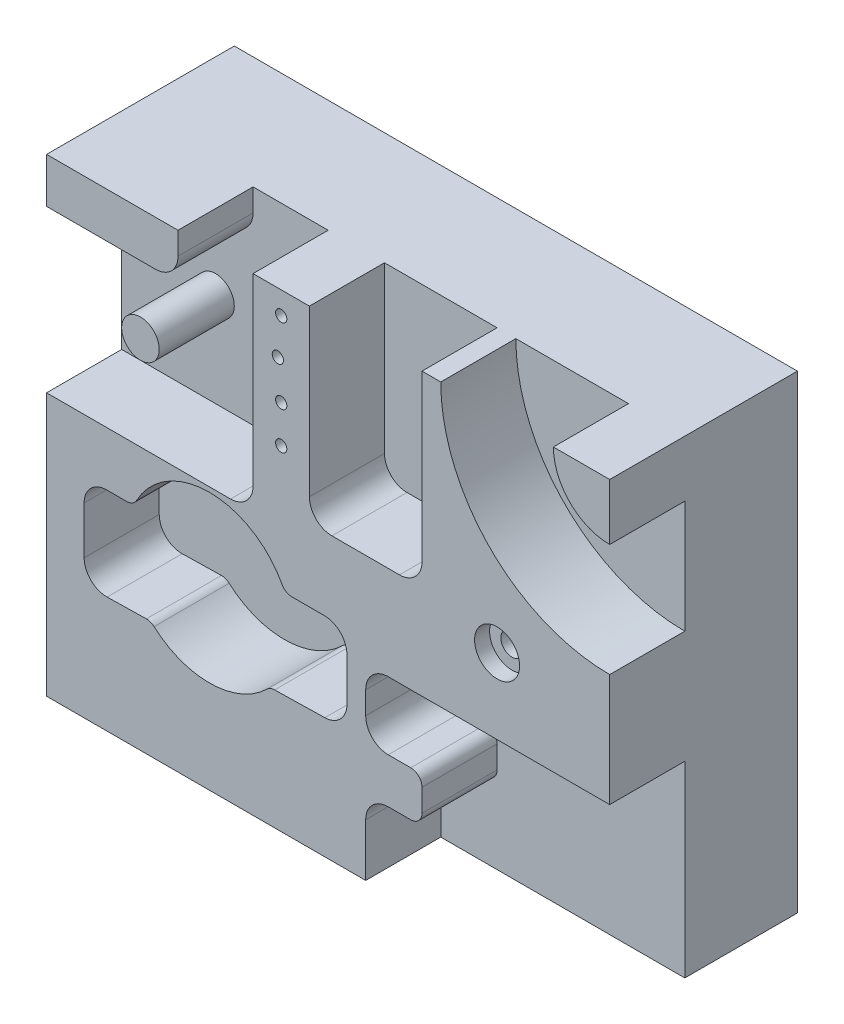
ISO-10303-21;
HEADER;
FILE_DESCRIPTION(('STEP AP214'),'2;1');
FILE_NAME('part.step','',(''),(''),'','','');
FILE_SCHEMA(('AUTOMOTIVE_DESIGN { 1 0 10303 214 1 1 1 1 }'));
ENDSEC;
DATA;
#1=APPLICATION_CONTEXT('core data for automotive mechanical design processes');
#2=APPLICATION_PROTOCOL_DEFINITION('international standard','automotive_design',2000,#1);
#3=PRODUCT_CONTEXT('',#1,'mechanical');
#4=PRODUCT('Part','Part','',(#3));
#5=PRODUCT_RELATED_PRODUCT_CATEGORY('part','',(#4));
#6=PRODUCT_DEFINITION_FORMATION('','',#4);
#7=PRODUCT_DEFINITION_CONTEXT('part definition',#1,'design');
#8=PRODUCT_DEFINITION('design','',#6,#7);
#9=PRODUCT_DEFINITION_SHAPE('','',#8);
#10=(LENGTH_UNIT() NAMED_UNIT(*) SI_UNIT(.MILLI.,.METRE.));
#11=(NAMED_UNIT(*) PLANE_ANGLE_UNIT() SI_UNIT($,.RADIAN.));
#12=(NAMED_UNIT(*) SI_UNIT($,.STERADIAN.) SOLID_ANGLE_UNIT());
#13=UNCERTAINTY_MEASURE_WITH_UNIT(LENGTH_MEASURE(1.E-05),#10,'distance_accuracy_value','');
#14=(GEOMETRIC_REPRESENTATION_CONTEXT(3) GLOBAL_UNCERTAINTY_ASSIGNED_CONTEXT((#13)) GLOBAL_UNIT_ASSIGNED_CONTEXT((#10,
#11,#12)) REPRESENTATION_CONTEXT('',''));
#15=CARTESIAN_POINT('',(0.,0.,0.));
#16=DIRECTION('',(0.,0.,1.));
#17=DIRECTION('',(1.,0.,0.));
#18=AXIS2_PLACEMENT_3D('',#15,#16,#17);
#19=CARTESIAN_POINT('',(10.,-62.5,-20.));
#20=DIRECTION('',(0.,0.,-1.));
#21=DIRECTION('',(0.,1.,0.));
#22=AXIS2_PLACEMENT_3D('',#19,#20,#21);
#23=PLANE('',#22);
#24=CARTESIAN_POINT('',(75.,62.5,-20.));
#25=DIRECTION('',(0.,0.,1.));
#26=DIRECTION('',(-1.,0.,0.));
#27=AXIS2_PLACEMENT_3D('',#24,#25,#26);
#28=CIRCLE('',#27,15.);
#29=CARTESIAN_POINT('',(60.,62.5,-20.));
#30=VERTEX_POINT('',#29);
#31=CARTESIAN_POINT('',(75.,47.5,-20.));
#32=VERTEX_POINT('',#31);
#33=EDGE_CURVE('E473',#30,#32,#28,.T.);
#34=ORIENTED_EDGE('',*,*,#33,.F.);
#35=DIRECTION('',(-1.,0.,0.));
#36=VECTOR('',#35,1.);
#37=CARTESIAN_POINT('',(75.,62.5,-20.));
#38=LINE('',#37,#36);
#39=CARTESIAN_POINT('',(30.,62.5,-20.));
#40=VERTEX_POINT('',#39);
#41=EDGE_CURVE('E492',#30,#40,#38,.T.);
#42=ORIENTED_EDGE('',*,*,#41,.T.);
#43=CARTESIAN_POINT('',(75.,62.5,-20.));
#44=DIRECTION('',(0.,0.,-1.));
#45=DIRECTION('',(0.,1.,0.));
#46=AXIS2_PLACEMENT_3D('',#43,#44,#45);
#47=CIRCLE('',#46,45.);
#48=CARTESIAN_POINT('',(75.,17.5,-20.));
#49=VERTEX_POINT('',#48);
#50=EDGE_CURVE('E499',#40,#49,#47,.F.);
#51=ORIENTED_EDGE('',*,*,#50,.T.);
#52=DIRECTION('',(0.,1.,0.));
#53=VECTOR('',#52,1.);
#54=CARTESIAN_POINT('',(75.,17.5,-20.));
#55=LINE('',#54,#53);
#56=EDGE_CURVE('E495',#49,#32,#55,.T.);
#57=ORIENTED_EDGE('',*,*,#56,.T.);
#58=EDGE_LOOP('',(#34,#42,#51,#57));
#59=FACE_BOUND('',#58,.T.);
#60=ADVANCED_FACE('F32',(#59),#23,.F.);
#61=CARTESIAN_POINT('',(10.,-62.5,-20.));
#62=DIRECTION('',(0.,0.,-1.));
#63=DIRECTION('',(0.,1.,0.));
#64=AXIS2_PLACEMENT_3D('',#61,#62,#63);
#65=PLANE('',#64);
#66=CARTESIAN_POINT('',(-50.,32.5,-20.));
#67=DIRECTION('',(0.,0.,-1.));
#68=DIRECTION('',(0.,1.,0.));
#69=AXIS2_PLACEMENT_3D('',#66,#67,#68);
#70=CIRCLE('',#69,5.);
#71=CARTESIAN_POINT('',(-50.,37.5,-20.));
#72=VERTEX_POINT('',#71);
#73=EDGE_CURVE('E615',#72,#72,#70,.F.);
#74=ORIENTED_EDGE('',*,*,#73,.F.);
#75=EDGE_LOOP('',(#74));
#76=FACE_BOUND('',#75,.T.);
#77=DIRECTION('',(1.,0.,0.));
#78=VECTOR('',#77,1.);
#79=CARTESIAN_POINT('',(-75.,7.49999999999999,-20.));
#80=LINE('',#79,#78);
#81=CARTESIAN_POINT('',(-75.,7.49999999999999,-20.));
#82=VERTEX_POINT('',#81);
#83=CARTESIAN_POINT('',(-26.,7.49999999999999,-20.));
#84=VERTEX_POINT('',#83);
#85=EDGE_CURVE('E532',#82,#84,#80,.T.);
#86=ORIENTED_EDGE('',*,*,#85,.T.);
#87=CARTESIAN_POINT('',(-26.,13.5,-20.));
#88=DIRECTION('',(0.,0.,-1.));
#89=DIRECTION('',(0.,1.,0.));
#90=AXIS2_PLACEMENT_3D('',#87,#88,#89);
#91=CIRCLE('',#90,6.);
#92=CARTESIAN_POINT('',(-20.,13.5,-20.));
#93=VERTEX_POINT('',#92);
#94=EDGE_CURVE('E699',#84,#93,#91,.F.);
#95=ORIENTED_EDGE('',*,*,#94,.T.);
#96=DIRECTION('',(0.,1.,0.));
#97=VECTOR('',#96,1.);
#98=CARTESIAN_POINT('',(-20.,7.5,-20.));
#99=LINE('',#98,#97);
#100=CARTESIAN_POINT('',(-20.,62.5,-20.));
#101=VERTEX_POINT('',#100);
#102=EDGE_CURVE('E537',#93,#101,#99,.T.);
#103=ORIENTED_EDGE('',*,*,#102,.T.);
#104=DIRECTION('',(-1.,0.,0.));
#105=VECTOR('',#104,1.);
#106=CARTESIAN_POINT('',(-20.,62.5,-20.));
#107=LINE('',#106,#105);
#108=CARTESIAN_POINT('',(-40.,62.5,-20.));
#109=VERTEX_POINT('',#108);
#110=EDGE_CURVE('E541',#101,#109,#107,.T.);
#111=ORIENTED_EDGE('',*,*,#110,.T.);
#112=DIRECTION('',(0.,1.,0.));
#113=VECTOR('',#112,1.);
#114=CARTESIAN_POINT('',(-40.,62.5,-20.));
#115=LINE('',#114,#113);
#116=CARTESIAN_POINT('',(-40.,56.5,-20.));
#117=VERTEX_POINT('',#116);
#118=EDGE_CURVE('E505',#117,#109,#115,.T.);
#119=ORIENTED_EDGE('',*,*,#118,.F.);
#120=CARTESIAN_POINT('',(-46.,56.5,-20.));
#121=DIRECTION('',(0.,0.,-1.));
#122=DIRECTION('',(0.,1.,0.));
#123=AXIS2_PLACEMENT_3D('',#120,#121,#122);
#124=CIRCLE('',#123,6.);
#125=CARTESIAN_POINT('',(-46.,50.5,-20.));
#126=VERTEX_POINT('',#125);
#127=EDGE_CURVE('E692',#117,#126,#124,.T.);
#128=ORIENTED_EDGE('',*,*,#127,.T.);
#129=DIRECTION('',(1.,0.,0.));
#130=VECTOR('',#129,1.);
#131=CARTESIAN_POINT('',(-40.,50.5,-20.));
#132=LINE('',#131,#130);
#133=CARTESIAN_POINT('',(-75.,50.5,-20.));
#134=VERTEX_POINT('',#133);
#135=EDGE_CURVE('E508',#134,#126,#132,.T.);
#136=ORIENTED_EDGE('',*,*,#135,.F.);
#137=DIRECTION('',(0.,-1.,0.));
#138=VECTOR('',#137,1.);
#139=CARTESIAN_POINT('',(-75.,62.5,-20.));
#140=LINE('',#139,#138);
#141=EDGE_CURVE('E538',#134,#82,#140,.T.);
#142=ORIENTED_EDGE('',*,*,#141,.T.);
#143=EDGE_LOOP('',(#86,#95,#103,#111,#119,#128,#136,#142));
#144=FACE_BOUND('',#143,.T.);
#145=ADVANCED_FACE('F863',(#76,#144),#65,.F.);
#146=CARTESIAN_POINT('',(10.,-62.5,-20.));
#147=DIRECTION('',(0.,0.,-1.));
#148=DIRECTION('',(0.,1.,0.));
#149=AXIS2_PLACEMENT_3D('',#146,#147,#148);
#150=PLANE('',#149);
#151=DIRECTION('',(1.,0.,0.));
#152=VECTOR('',#151,1.);
#153=CARTESIAN_POINT('',(25.,-42.5,-20.));
#154=LINE('',#153,#152);
#155=CARTESIAN_POINT('',(16.,-42.5,-20.));
#156=VERTEX_POINT('',#155);
#157=CARTESIAN_POINT('',(22.,-42.5,-20.));
#158=VERTEX_POINT('',#157);
#159=EDGE_CURVE('E549',#156,#158,#154,.T.);
#160=ORIENTED_EDGE('',*,*,#159,.F.);
#161=CARTESIAN_POINT('',(16.,-48.5,-20.));
#162=DIRECTION('',(0.,0.,-1.));
#163=DIRECTION('',(0.,1.,0.));
#164=AXIS2_PLACEMENT_3D('',#161,#162,#163);
#165=CIRCLE('',#164,6.);
#166=CARTESIAN_POINT('',(10.,-48.5,-20.));
#167=VERTEX_POINT('',#166);
#168=EDGE_CURVE('E733',#156,#167,#165,.F.);
#169=ORIENTED_EDGE('',*,*,#168,.T.);
#170=DIRECTION('',(0.,1.,0.));
#171=VECTOR('',#170,1.);
#172=CARTESIAN_POINT('',(10.,-62.5,-20.));
#173=LINE('',#172,#171);
#174=CARTESIAN_POINT('',(10.,-62.5,-20.));
#175=VERTEX_POINT('',#174);
#176=EDGE_CURVE('E571',#175,#167,#173,.T.);
#177=ORIENTED_EDGE('',*,*,#176,.F.);
#178=DIRECTION('',(1.,0.,0.));
#179=VECTOR('',#178,1.);
#180=CARTESIAN_POINT('',(10.,-62.5,-20.));
#181=LINE('',#180,#179);
#182=CARTESIAN_POINT('',(75.,-62.5,-20.));
#183=VERTEX_POINT('',#182);
#184=EDGE_CURVE('E578',#175,#183,#181,.T.);
#185=ORIENTED_EDGE('',*,*,#184,.T.);
#186=DIRECTION('',(0.,1.,0.));
#187=VECTOR('',#186,1.);
#188=CARTESIAN_POINT('',(75.,-62.5,-20.));
#189=LINE('',#188,#187);
#190=CARTESIAN_POINT('',(75.,-12.5,-20.));
#191=VERTEX_POINT('',#190);
#192=EDGE_CURVE('E561',#183,#191,#189,.T.);
#193=ORIENTED_EDGE('',*,*,#192,.T.);
#194=DIRECTION('',(1.,0.,0.));
#195=VECTOR('',#194,1.);
#196=CARTESIAN_POINT('',(10.,-12.5,-20.));
#197=LINE('',#196,#195);
#198=CARTESIAN_POINT('',(16.,-12.5,-20.));
#199=VERTEX_POINT('',#198);
#200=EDGE_CURVE('E586',#199,#191,#197,.T.);
#201=ORIENTED_EDGE('',*,*,#200,.F.);
#202=CARTESIAN_POINT('',(16.,-18.5,-20.));
#203=DIRECTION('',(0.,0.,-1.));
#204=DIRECTION('',(0.,1.,0.));
#205=AXIS2_PLACEMENT_3D('',#202,#203,#204);
#206=CIRCLE('',#205,6.);
#207=CARTESIAN_POINT('',(10.,-18.5,-20.));
#208=VERTEX_POINT('',#207);
#209=EDGE_CURVE('E729',#199,#208,#206,.F.);
#210=ORIENTED_EDGE('',*,*,#209,.T.);
#211=CARTESIAN_POINT('',(10.,-24.5,-20.));
#212=VERTEX_POINT('',#211);
#213=EDGE_CURVE('E569',#212,#208,#173,.T.);
#214=ORIENTED_EDGE('',*,*,#213,.F.);
#215=CARTESIAN_POINT('',(16.,-24.5,-20.));
#216=DIRECTION('',(0.,0.,-1.));
#217=DIRECTION('',(0.,1.,0.));
#218=AXIS2_PLACEMENT_3D('',#215,#216,#217);
#219=CIRCLE('',#218,6.);
#220=CARTESIAN_POINT('',(16.,-30.5,-20.));
#221=VERTEX_POINT('',#220);
#222=EDGE_CURVE('E731',#212,#221,#219,.F.);
#223=ORIENTED_EDGE('',*,*,#222,.T.);
#224=DIRECTION('',(-1.,0.,0.));
#225=VECTOR('',#224,1.);
#226=CARTESIAN_POINT('',(10.,-30.5,-20.));
#227=LINE('',#226,#225);
#228=CARTESIAN_POINT('',(22.,-30.5,-20.));
#229=VERTEX_POINT('',#228);
#230=EDGE_CURVE('E550',#229,#221,#227,.T.);
#231=ORIENTED_EDGE('',*,*,#230,.F.);
#232=CARTESIAN_POINT('',(22.,-33.5,-20.));
#233=DIRECTION('',(0.,0.,-1.));
#234=DIRECTION('',(0.,1.,0.));
#235=AXIS2_PLACEMENT_3D('',#232,#233,#234);
#236=CIRCLE('',#235,3.);
#237=CARTESIAN_POINT('',(25.,-33.5,-20.));
#238=VERTEX_POINT('',#237);
#239=EDGE_CURVE('E675',#229,#238,#236,.T.);
#240=ORIENTED_EDGE('',*,*,#239,.T.);
#241=DIRECTION('',(0.,1.,0.));
#242=VECTOR('',#241,1.);
#243=CARTESIAN_POINT('',(25.,-30.5,-20.));
#244=LINE('',#243,#242);
#245=CARTESIAN_POINT('',(25.,-39.5,-20.));
#246=VERTEX_POINT('',#245);
#247=EDGE_CURVE('E554',#246,#238,#244,.T.);
#248=ORIENTED_EDGE('',*,*,#247,.F.);
#249=CARTESIAN_POINT('',(22.,-39.5,-20.));
#250=DIRECTION('',(0.,0.,-1.));
#251=DIRECTION('',(0.,1.,0.));
#252=AXIS2_PLACEMENT_3D('',#249,#250,#251);
#253=CIRCLE('',#252,3.);
#254=EDGE_CURVE('E672',#246,#158,#253,.T.);
#255=ORIENTED_EDGE('',*,*,#254,.T.);
#256=EDGE_LOOP('',(#160,#169,#177,#185,#193,#201,#210,#214,#223,#231,#240,#248,#255));
#257=FACE_BOUND('',#256,.T.);
#258=ADVANCED_FACE('F869',(#257),#150,.F.);
#259=CARTESIAN_POINT('',(10.,-62.5,-20.));
#260=DIRECTION('',(1.,0.,0.));
#261=DIRECTION('',(0.,0.,-1.));
#262=AXIS2_PLACEMENT_3D('',#259,#260,#261);
#263=PLANE('',#262);
#264=ORIENTED_EDGE('',*,*,#176,.T.);
#265=DIRECTION('',(0.,0.,-1.));
#266=VECTOR('',#265,1.);
#267=CARTESIAN_POINT('',(10.,-48.5,-20.));
#268=LINE('',#267,#266);
#269=CARTESIAN_POINT('',(10.,-48.5,0.));
#270=VERTEX_POINT('',#269);
#271=EDGE_CURVE('E735',#167,#270,#268,.F.);
#272=ORIENTED_EDGE('',*,*,#271,.T.);
#273=DIRECTION('',(0.,-1.,0.));
#274=VECTOR('',#273,1.);
#275=CARTESIAN_POINT('',(10.,-12.5,0.));
#276=LINE('',#275,#274);
#277=CARTESIAN_POINT('',(10.,-62.5,0.));
#278=VERTEX_POINT('',#277);
#279=EDGE_CURVE('E574',#270,#278,#276,.T.);
#280=ORIENTED_EDGE('',*,*,#279,.T.);
#281=DIRECTION('',(0.,0.,-1.));
#282=VECTOR('',#281,1.);
#283=CARTESIAN_POINT('',(10.,-62.5,0.));
#284=LINE('',#283,#282);
#285=EDGE_CURVE('E566',#278,#175,#284,.T.);
#286=ORIENTED_EDGE('',*,*,#285,.T.);
#287=EDGE_LOOP('',(#264,#272,#280,#286));
#288=FACE_BOUND('',#287,.T.);
#289=ADVANCED_FACE('F918',(#288),#263,.T.);
#290=CARTESIAN_POINT('',(10.,-18.5,0.));
#291=VERTEX_POINT('',#290);
#292=CARTESIAN_POINT('',(10.,-24.5,0.));
#293=VERTEX_POINT('',#292);
#294=EDGE_CURVE('E575',#291,#293,#276,.T.);
#295=ORIENTED_EDGE('',*,*,#294,.T.);
#296=DIRECTION('',(0.,0.,-1.));
#297=VECTOR('',#296,1.);
#298=CARTESIAN_POINT('',(10.,-24.5,-20.));
#299=LINE('',#298,#297);
#300=EDGE_CURVE('E740',#293,#212,#299,.T.);
#301=ORIENTED_EDGE('',*,*,#300,.T.);
#302=ORIENTED_EDGE('',*,*,#213,.T.);
#303=DIRECTION('',(0.,0.,1.));
#304=VECTOR('',#303,1.);
#305=CARTESIAN_POINT('',(10.,-18.5,-20.));
#306=LINE('',#305,#304);
#307=EDGE_CURVE('E737',#208,#291,#306,.T.);
#308=ORIENTED_EDGE('',*,*,#307,.T.);
#309=EDGE_LOOP('',(#295,#301,#302,#308));
#310=FACE_BOUND('',#309,.T.);
#311=ADVANCED_FACE('F921',(#310),#263,.T.);
#312=CARTESIAN_POINT('',(-75.,62.5,-50.));
#313=DIRECTION('',(-1.,0.,0.));
#314=DIRECTION('',(0.,-1.,0.));
#315=AXIS2_PLACEMENT_3D('',#312,#313,#314);
#316=PLANE('',#315);
#317=ORIENTED_EDGE('',*,*,#141,.F.);
#318=DIRECTION('',(0.,0.,-1.));
#319=VECTOR('',#318,1.);
#320=CARTESIAN_POINT('',(-75.,50.5,37.));
#321=LINE('',#320,#319);
#322=CARTESIAN_POINT('',(-75.,50.5,0.));
#323=VERTEX_POINT('',#322);
#324=EDGE_CURVE('E497',#323,#134,#321,.T.);
#325=ORIENTED_EDGE('',*,*,#324,.F.);
#326=DIRECTION('',(0.,-1.,0.));
#327=VECTOR('',#326,1.);
#328=CARTESIAN_POINT('',(-75.,50.5,0.));
#329=LINE('',#328,#327);
#330=CARTESIAN_POINT('',(-75.,62.5,0.));
#331=VERTEX_POINT('',#330);
#332=EDGE_CURVE('E520',#331,#323,#329,.T.);
#333=ORIENTED_EDGE('',*,*,#332,.F.);
#334=DIRECTION('',(0.,0.,1.));
#335=VECTOR('',#334,1.);
#336=CARTESIAN_POINT('',(-75.,62.5,-50.));
#337=LINE('',#336,#335);
#338=CARTESIAN_POINT('',(-75.,62.5,-50.));
#339=VERTEX_POINT('',#338);
#340=EDGE_CURVE('E613',#339,#331,#337,.T.);
#341=ORIENTED_EDGE('',*,*,#340,.F.);
#342=DIRECTION('',(0.,-1.,0.));
#343=VECTOR('',#342,1.);
#344=CARTESIAN_POINT('',(-75.,62.5,-50.));
#345=LINE('',#344,#343);
#346=CARTESIAN_POINT('',(-75.,-62.5,-50.));
#347=VERTEX_POINT('',#346);
#348=EDGE_CURVE('E589',#339,#347,#345,.T.);
#349=ORIENTED_EDGE('',*,*,#348,.T.);
#350=DIRECTION('',(0.,0.,1.));
#351=VECTOR('',#350,1.);
#352=CARTESIAN_POINT('',(-75.,-62.5,-50.));
#353=LINE('',#352,#351);
#354=CARTESIAN_POINT('',(-75.,-62.5,0.));
#355=VERTEX_POINT('',#354);
#356=EDGE_CURVE('E602',#347,#355,#353,.T.);
#357=ORIENTED_EDGE('',*,*,#356,.T.);
#358=DIRECTION('',(0.,-1.,0.));
#359=VECTOR('',#358,1.);
#360=CARTESIAN_POINT('',(-75.,62.5,0.));
#361=LINE('',#360,#359);
#362=CARTESIAN_POINT('',(-75.,7.49999999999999,0.));
#363=VERTEX_POINT('',#362);
#364=EDGE_CURVE('E585',#363,#355,#361,.T.);
#365=ORIENTED_EDGE('',*,*,#364,.F.);
#366=DIRECTION('',(0.,0.,1.));
#367=VECTOR('',#366,1.);
#368=CARTESIAN_POINT('',(-75.,7.49999999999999,-97.7817459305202));
#369=LINE('',#368,#367);
#370=EDGE_CURVE('E540',#82,#363,#369,.T.);
#371=ORIENTED_EDGE('',*,*,#370,.F.);
#372=EDGE_LOOP('',(#317,#325,#333,#341,#349,#357,#365,#371));
#373=FACE_BOUND('',#372,.T.);
#374=ADVANCED_FACE('F941',(#373),#316,.T.);
#375=CARTESIAN_POINT('',(75.,62.5,-50.));
#376=DIRECTION('',(0.,1.,0.));
#377=DIRECTION('',(-1.,0.,0.));
#378=AXIS2_PLACEMENT_3D('',#375,#376,#377);
#379=PLANE('',#378);
#380=DIRECTION('',(0.,0.,-1.));
#381=VECTOR('',#380,1.);
#382=CARTESIAN_POINT('',(25.,62.5,0.));
#383=LINE('',#382,#381);
#384=CARTESIAN_POINT('',(25.,62.5,0.));
#385=VERTEX_POINT('',#384);
#386=CARTESIAN_POINT('',(25.,62.5,-20.));
#387=VERTEX_POINT('',#386);
#388=EDGE_CURVE('E454',#385,#387,#383,.T.);
#389=ORIENTED_EDGE('',*,*,#388,.F.);
#390=DIRECTION('',(-1.,0.,0.));
#391=VECTOR('',#390,1.);
#392=CARTESIAN_POINT('',(75.,62.5,0.));
#393=LINE('',#392,#391);
#394=CARTESIAN_POINT('',(30.,62.5,0.));
#395=VERTEX_POINT('',#394);
#396=EDGE_CURVE('E593',#395,#385,#393,.T.);
#397=ORIENTED_EDGE('',*,*,#396,.F.);
#398=DIRECTION('',(0.,0.,1.));
#399=VECTOR('',#398,1.);
#400=CARTESIAN_POINT('',(30.,62.5,-83.6396103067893));
#401=LINE('',#400,#399);
#402=EDGE_CURVE('E494',#40,#395,#401,.T.);
#403=ORIENTED_EDGE('',*,*,#402,.F.);
#404=ORIENTED_EDGE('',*,*,#41,.F.);
#405=DIRECTION('',(0.,0.,-1.));
#406=VECTOR('',#405,1.);
#407=CARTESIAN_POINT('',(60.,62.5,21.2132034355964));
#408=LINE('',#407,#406);
#409=CARTESIAN_POINT('',(60.,62.5,0.));
#410=VERTEX_POINT('',#409);
#411=EDGE_CURVE('E467',#410,#30,#408,.T.);
#412=ORIENTED_EDGE('',*,*,#411,.F.);
#413=DIRECTION('',(-1.,0.,0.));
#414=VECTOR('',#413,1.);
#415=CARTESIAN_POINT('',(60.,62.5,0.));
#416=LINE('',#415,#414);
#417=CARTESIAN_POINT('',(75.,62.5,0.));
#418=VERTEX_POINT('',#417);
#419=EDGE_CURVE('E484',#418,#410,#416,.T.);
#420=ORIENTED_EDGE('',*,*,#419,.F.);
#421=DIRECTION('',(0.,0.,1.));
#422=VECTOR('',#421,1.);
#423=CARTESIAN_POINT('',(75.,62.5,-50.));
#424=LINE('',#423,#422);
#425=CARTESIAN_POINT('',(75.,62.5,-50.));
#426=VERTEX_POINT('',#425);
#427=EDGE_CURVE('E616',#426,#418,#424,.T.);
#428=ORIENTED_EDGE('',*,*,#427,.F.);
#429=DIRECTION('',(-1.,0.,0.));
#430=VECTOR('',#429,1.);
#431=CARTESIAN_POINT('',(75.,62.5,-50.));
#432=LINE('',#431,#430);
#433=EDGE_CURVE('E599',#426,#339,#432,.T.);
#434=ORIENTED_EDGE('',*,*,#433,.T.);
#435=ORIENTED_EDGE('',*,*,#340,.T.);
#436=DIRECTION('',(-1.,0.,0.));
#437=VECTOR('',#436,1.);
#438=CARTESIAN_POINT('',(-75.,62.5,0.));
#439=LINE('',#438,#437);
#440=CARTESIAN_POINT('',(-40.,62.5,0.));
#441=VERTEX_POINT('',#440);
#442=EDGE_CURVE('E511',#441,#331,#439,.T.);
#443=ORIENTED_EDGE('',*,*,#442,.F.);
#444=DIRECTION('',(0.,0.,-1.));
#445=VECTOR('',#444,1.);
#446=CARTESIAN_POINT('',(-40.,62.5,37.));
#447=LINE('',#446,#445);
#448=EDGE_CURVE('E507',#441,#109,#447,.T.);
#449=ORIENTED_EDGE('',*,*,#448,.T.);
#450=ORIENTED_EDGE('',*,*,#110,.F.);
#451=DIRECTION('',(0.,0.,1.));
#452=VECTOR('',#451,1.);
#453=CARTESIAN_POINT('',(-20.,62.5,-97.7817459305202));
#454=LINE('',#453,#452);
#455=CARTESIAN_POINT('',(-20.,62.5,0.));
#456=VERTEX_POINT('',#455);
#457=EDGE_CURVE('E544',#101,#456,#454,.T.);
#458=ORIENTED_EDGE('',*,*,#457,.T.);
#459=CARTESIAN_POINT('',(-4.99999999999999,62.5,0.));
#460=VERTEX_POINT('',#459);
#461=EDGE_CURVE('E610',#460,#456,#393,.T.);
#462=ORIENTED_EDGE('',*,*,#461,.F.);
#463=DIRECTION('',(0.,0.,1.));
#464=VECTOR('',#463,1.);
#465=CARTESIAN_POINT('',(-4.99999999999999,62.5,-20.));
#466=LINE('',#465,#464);
#467=CARTESIAN_POINT('',(-4.99999999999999,62.5,-20.));
#468=VERTEX_POINT('',#467);
#469=EDGE_CURVE('E460',#468,#460,#466,.T.);
#470=ORIENTED_EDGE('',*,*,#469,.F.);
#471=DIRECTION('',(-1.,0.,0.));
#472=VECTOR('',#471,1.);
#473=CARTESIAN_POINT('',(25.,62.5,-20.));
#474=LINE('',#473,#472);
#475=EDGE_CURVE('E434',#387,#468,#474,.T.);
#476=ORIENTED_EDGE('',*,*,#475,.F.);
#477=EDGE_LOOP('',(#389,#397,#403,#404,#412,#420,#428,#434,#435,#443,#449,#450,#458,#462,#470,#476));
#478=FACE_BOUND('',#477,.T.);
#479=ADVANCED_FACE('F937',(#478),#379,.T.);
#480=CARTESIAN_POINT('',(75.,-62.5,-50.));
#481=DIRECTION('',(1.,0.,0.));
#482=DIRECTION('',(0.,0.,-1.));
#483=AXIS2_PLACEMENT_3D('',#480,#481,#482);
#484=PLANE('',#483);
#485=ORIENTED_EDGE('',*,*,#56,.F.);
#486=DIRECTION('',(0.,0.,1.));
#487=VECTOR('',#486,1.);
#488=CARTESIAN_POINT('',(75.,17.5,-83.6396103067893));
#489=LINE('',#488,#487);
#490=CARTESIAN_POINT('',(75.,17.5,0.));
#491=VERTEX_POINT('',#490);
#492=EDGE_CURVE('E498',#49,#491,#489,.T.);
#493=ORIENTED_EDGE('',*,*,#492,.T.);
#494=DIRECTION('',(0.,1.,0.));
#495=VECTOR('',#494,1.);
#496=CARTESIAN_POINT('',(75.,-62.5,0.));
#497=LINE('',#496,#495);
#498=CARTESIAN_POINT('',(75.,-12.5,0.));
#499=VERTEX_POINT('',#498);
#500=EDGE_CURVE('E607',#499,#491,#497,.T.);
#501=ORIENTED_EDGE('',*,*,#500,.F.);
#502=DIRECTION('',(0.,0.,1.));
#503=VECTOR('',#502,1.);
#504=CARTESIAN_POINT('',(75.,-12.5,-20.));
#505=LINE('',#504,#503);
#506=EDGE_CURVE('E570',#191,#499,#505,.T.);
#507=ORIENTED_EDGE('',*,*,#506,.F.);
#508=ORIENTED_EDGE('',*,*,#192,.F.);
#509=DIRECTION('',(0.,0.,1.));
#510=VECTOR('',#509,1.);
#511=CARTESIAN_POINT('',(75.,-62.5,-50.));
#512=LINE('',#511,#510);
#513=CARTESIAN_POINT('',(75.,-62.5,-50.));
#514=VERTEX_POINT('',#513);
#515=EDGE_CURVE('E618',#514,#183,#512,.T.);
#516=ORIENTED_EDGE('',*,*,#515,.F.);
#517=DIRECTION('',(0.,1.,0.));
#518=VECTOR('',#517,1.);
#519=CARTESIAN_POINT('',(75.,-62.5,-50.));
#520=LINE('',#519,#518);
#521=EDGE_CURVE('E596',#514,#426,#520,.T.);
#522=ORIENTED_EDGE('',*,*,#521,.T.);
#523=ORIENTED_EDGE('',*,*,#427,.T.);
#524=DIRECTION('',(0.,1.,0.));
#525=VECTOR('',#524,1.);
#526=CARTESIAN_POINT('',(75.,62.5,0.));
#527=LINE('',#526,#525);
#528=CARTESIAN_POINT('',(75.,47.5,0.));
#529=VERTEX_POINT('',#528);
#530=EDGE_CURVE('E477',#529,#418,#527,.T.);
#531=ORIENTED_EDGE('',*,*,#530,.F.);
#532=DIRECTION('',(0.,0.,-1.));
#533=VECTOR('',#532,1.);
#534=CARTESIAN_POINT('',(75.,47.5,21.2132034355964));
#535=LINE('',#534,#533);
#536=EDGE_CURVE('E476',#529,#32,#535,.T.);
#537=ORIENTED_EDGE('',*,*,#536,.T.);
#538=EDGE_LOOP('',(#485,#493,#501,#507,#508,#516,#522,#523,#531,#537));
#539=FACE_BOUND('',#538,.T.);
#540=ADVANCED_FACE('F940',(#539),#484,.T.);
#541=CARTESIAN_POINT('',(-75.,-62.5,-50.));
#542=DIRECTION('',(0.,-1.,0.));
#543=DIRECTION('',(0.,0.,-1.));
#544=AXIS2_PLACEMENT_3D('',#541,#542,#543);
#545=PLANE('',#544);
#546=ORIENTED_EDGE('',*,*,#184,.F.);
#547=ORIENTED_EDGE('',*,*,#285,.F.);
#548=DIRECTION('',(1.,0.,0.));
#549=VECTOR('',#548,1.);
#550=CARTESIAN_POINT('',(-75.,-62.5,0.));
#551=LINE('',#550,#549);
#552=EDGE_CURVE('E604',#355,#278,#551,.T.);
#553=ORIENTED_EDGE('',*,*,#552,.F.);
#554=ORIENTED_EDGE('',*,*,#356,.F.);
#555=DIRECTION('',(1.,0.,0.));
#556=VECTOR('',#555,1.);
#557=CARTESIAN_POINT('',(-75.,-62.5,-50.));
#558=LINE('',#557,#556);
#559=EDGE_CURVE('E592',#347,#514,#558,.T.);
#560=ORIENTED_EDGE('',*,*,#559,.T.);
#561=ORIENTED_EDGE('',*,*,#515,.T.);
#562=EDGE_LOOP('',(#546,#547,#553,#554,#560,#561));
#563=FACE_BOUND('',#562,.T.);
#564=ADVANCED_FACE('F932',(#563),#545,.T.);
#565=CARTESIAN_POINT('',(-75.,-62.5,-50.));
#566=DIRECTION('',(0.,0.,1.));
#567=DIRECTION('',(1.,0.,0.));
#568=AXIS2_PLACEMENT_3D('',#565,#566,#567);
#569=PLANE('',#568);
#570=ORIENTED_EDGE('',*,*,#348,.F.);
#571=ORIENTED_EDGE('',*,*,#433,.F.);
#572=ORIENTED_EDGE('',*,*,#521,.F.);
#573=ORIENTED_EDGE('',*,*,#559,.F.);
#574=EDGE_LOOP('',(#570,#571,#572,#573));
#575=FACE_BOUND('',#574,.T.);
#576=ADVANCED_FACE('F929',(#575),#569,.F.);
#577=CARTESIAN_POINT('',(-75.,-62.5,0.));
#578=DIRECTION('',(0.,0.,1.));
#579=DIRECTION('',(1.,0.,0.));
#580=AXIS2_PLACEMENT_3D('',#577,#578,#579);
#581=PLANE('',#580);
#582=CARTESIAN_POINT('',(-13.4017837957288,46.5,0.));
#583=DIRECTION('',(0.,0.,1.));
#584=DIRECTION('',(1.,0.,0.));
#585=AXIS2_PLACEMENT_3D('',#582,#583,#584);
#586=CIRCLE('',#585,1.5);
#587=CARTESIAN_POINT('',(-11.9017837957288,46.5,0.));
#588=VERTEX_POINT('',#587);
#589=EDGE_CURVE('E371',#588,#588,#586,.T.);
#590=ORIENTED_EDGE('',*,*,#589,.F.);
#591=EDGE_LOOP('',(#590));
#592=FACE_BOUND('',#591,.T.);
#593=CARTESIAN_POINT('',(-12.5,56.5,0.));
#594=DIRECTION('',(0.,0.,1.));
#595=DIRECTION('',(1.,0.,0.));
#596=AXIS2_PLACEMENT_3D('',#593,#594,#595);
#597=CIRCLE('',#596,1.5);
#598=CARTESIAN_POINT('',(-11.,56.5,0.));
#599=VERTEX_POINT('',#598);
#600=EDGE_CURVE('E370',#599,#599,#597,.T.);
#601=ORIENTED_EDGE('',*,*,#600,.F.);
#602=EDGE_LOOP('',(#601));
#603=FACE_BOUND('',#602,.T.);
#604=CARTESIAN_POINT('',(-12.5,36.5,0.));
#605=DIRECTION('',(0.,0.,1.));
#606=DIRECTION('',(1.,0.,0.));
#607=AXIS2_PLACEMENT_3D('',#604,#605,#606);
#608=CIRCLE('',#607,1.5);
#609=CARTESIAN_POINT('',(-11.,36.5,0.));
#610=VERTEX_POINT('',#609);
#611=EDGE_CURVE('E381',#610,#610,#608,.T.);
#612=ORIENTED_EDGE('',*,*,#611,.F.);
#613=EDGE_LOOP('',(#612));
#614=FACE_BOUND('',#613,.T.);
#615=CARTESIAN_POINT('',(-12.5,26.5,0.));
#616=DIRECTION('',(0.,0.,1.));
#617=DIRECTION('',(1.,0.,0.));
#618=AXIS2_PLACEMENT_3D('',#615,#616,#617);
#619=CIRCLE('',#618,1.5);
#620=CARTESIAN_POINT('',(-11.,26.5,0.));
#621=VERTEX_POINT('',#620);
#622=EDGE_CURVE('E387',#621,#621,#619,.T.);
#623=ORIENTED_EDGE('',*,*,#622,.F.);
#624=EDGE_LOOP('',(#623));
#625=FACE_BOUND('',#624,.T.);
#626=CARTESIAN_POINT('',(45.,7.50000000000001,0.));
#627=DIRECTION('',(0.,0.,1.));
#628=DIRECTION('',(1.,0.,0.));
#629=AXIS2_PLACEMENT_3D('',#626,#627,#628);
#630=CIRCLE('',#629,6.);
#631=CARTESIAN_POINT('',(51.,7.50000000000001,0.));
#632=VERTEX_POINT('',#631);
#633=EDGE_CURVE('E393',#632,#632,#630,.T.);
#634=ORIENTED_EDGE('',*,*,#633,.F.);
#635=EDGE_LOOP('',(#634));
#636=FACE_BOUND('',#635,.T.);
#637=DIRECTION('',(0.99979752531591,0.0201223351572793,0.));
#638=VECTOR('',#637,1.);
#639=CARTESIAN_POINT('',(-15.4937660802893,-30.6908385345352,0.));
#640=LINE('',#639,#638);
#641=CARTESIAN_POINT('',(-14.2653236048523,-30.6661143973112,0.));
#642=VERTEX_POINT('',#641);
#643=CARTESIAN_POINT('',(-0.879265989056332,-30.3967011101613,0.));
#644=VERTEX_POINT('',#643);
#645=EDGE_CURVE('E423',#642,#644,#640,.T.);
#646=ORIENTED_EDGE('',*,*,#645,.F.);
#647=CARTESIAN_POINT('',(-14.2049565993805,-33.6655069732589,0.));
#648=DIRECTION('',(0.,0.,1.));
#649=DIRECTION('',(1.,0.,0.));
#650=AXIS2_PLACEMENT_3D('',#647,#648,#649);
#651=CIRCLE('',#650,3.);
#652=CARTESIAN_POINT('',(-16.2981155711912,-31.5163942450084,0.));
#653=VERTEX_POINT('',#652);
#654=EDGE_CURVE('E641',#642,#653,#651,.T.);
#655=ORIENTED_EDGE('',*,*,#654,.T.);
#656=CARTESIAN_POINT('',(-31.6479480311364,-15.756234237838,0.));
#657=DIRECTION('',(0.,0.,1.));
#658=DIRECTION('',(1.,0.,0.));
#659=AXIS2_PLACEMENT_3D('',#656,#657,#658);
#660=CIRCLE('',#659,22.);
#661=CARTESIAN_POINT('',(-46.351215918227,-32.1212552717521,0.));
#662=VERTEX_POINT('',#661);
#663=EDGE_CURVE('E405',#662,#653,#660,.T.);
#664=ORIENTED_EDGE('',*,*,#663,.F.);
#665=CARTESIAN_POINT('',(-48.3562069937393,-34.352849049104,0.));
#666=DIRECTION('',(0.,0.,1.));
#667=DIRECTION('',(1.,0.,0.));
#668=AXIS2_PLACEMENT_3D('',#665,#666,#667);
#669=CIRCLE('',#668,3.);
#670=CARTESIAN_POINT('',(-48.4165739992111,-31.3534564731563,0.));
#671=VERTEX_POINT('',#670);
#672=EDGE_CURVE('E633',#662,#671,#669,.T.);
#673=ORIENTED_EDGE('',*,*,#672,.T.);
#674=DIRECTION('',(0.99979752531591,0.0201223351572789,0.));
#675=VECTOR('',#674,1.);
#676=CARTESIAN_POINT('',(-65.,-31.6872213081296,0.));
#677=LINE('',#676,#675);
#678=CARTESIAN_POINT('',(-58.8792659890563,-31.5640329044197,0.));
#679=VERTEX_POINT('',#678);
#680=EDGE_CURVE('E406',#679,#671,#677,.T.);
#681=ORIENTED_EDGE('',*,*,#680,.F.);
#682=CARTESIAN_POINT('',(-59.,-25.5652477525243,0.));
#683=DIRECTION('',(0.,0.,1.));
#684=DIRECTION('',(1.,0.,0.));
#685=AXIS2_PLACEMENT_3D('',#682,#683,#684);
#686=CIRCLE('',#685,6.);
#687=CARTESIAN_POINT('',(-65.,-25.5652477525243,0.));
#688=VERTEX_POINT('',#687);
#689=EDGE_CURVE('E767',#679,#688,#686,.F.);
#690=ORIENTED_EDGE('',*,*,#689,.T.);
#691=DIRECTION('',(0.,-1.,0.));
#692=VECTOR('',#691,1.);
#693=CARTESIAN_POINT('',(-65.,-6.90257627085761,0.));
#694=LINE('',#693,#692);
#695=CARTESIAN_POINT('',(-65.,-12.9025762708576,0.));
#696=VERTEX_POINT('',#695);
#697=EDGE_CURVE('E409',#696,#688,#694,.T.);
#698=ORIENTED_EDGE('',*,*,#697,.F.);
#699=CARTESIAN_POINT('',(-59.,-12.9025762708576,0.));
#700=DIRECTION('',(0.,0.,1.));
#701=DIRECTION('',(1.,0.,0.));
#702=AXIS2_PLACEMENT_3D('',#699,#700,#701);
#703=CIRCLE('',#702,6.);
#704=CARTESIAN_POINT('',(-59.,-6.90257627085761,0.));
#705=VERTEX_POINT('',#704);
#706=EDGE_CURVE('E769',#696,#705,#703,.F.);
#707=ORIENTED_EDGE('',*,*,#706,.T.);
#708=DIRECTION('',(-1.,0.,0.));
#709=VECTOR('',#708,1.);
#710=CARTESIAN_POINT('',(-51.7877777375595,-6.90257627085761,0.));
#711=LINE('',#710,#709);
#712=CARTESIAN_POINT('',(-53.6590995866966,-6.90257627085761,0.));
#713=VERTEX_POINT('',#712);
#714=EDGE_CURVE('E412',#713,#705,#711,.T.);
#715=ORIENTED_EDGE('',*,*,#714,.F.);
#716=CARTESIAN_POINT('',(-53.6590995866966,-3.90257627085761,0.));
#717=DIRECTION('',(0.,0.,1.));
#718=DIRECTION('',(1.,0.,0.));
#719=AXIS2_PLACEMENT_3D('',#716,#717,#718);
#720=CIRCLE('',#719,3.);
#721=CARTESIAN_POINT('',(-51.0177614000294,-5.32501522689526,0.));
#722=VERTEX_POINT('',#721);
#723=EDGE_CURVE('E636',#713,#722,#720,.T.);
#724=ORIENTED_EDGE('',*,*,#723,.T.);
#725=CARTESIAN_POINT('',(-31.6479480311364,-15.756234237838,0.));
#726=DIRECTION('',(0.,0.,1.));
#727=DIRECTION('',(1.,0.,0.));
#728=AXIS2_PLACEMENT_3D('',#725,#726,#727);
#729=CIRCLE('',#728,22.);
#730=CARTESIAN_POINT('',(-12.2781346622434,-5.32501522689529,0.));
#731=VERTEX_POINT('',#730);
#732=EDGE_CURVE('E415',#731,#722,#729,.T.);
#733=ORIENTED_EDGE('',*,*,#732,.F.);
#734=CARTESIAN_POINT('',(-9.63679647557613,-3.90257627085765,0.));
#735=DIRECTION('',(0.,0.,1.));
#736=DIRECTION('',(1.,0.,0.));
#737=AXIS2_PLACEMENT_3D('',#734,#735,#736);
#738=CIRCLE('',#737,3.);
#739=CARTESIAN_POINT('',(-9.63679647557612,-6.90257627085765,0.));
#740=VERTEX_POINT('',#739);
#741=EDGE_CURVE('E638',#731,#740,#738,.T.);
#742=ORIENTED_EDGE('',*,*,#741,.T.);
#743=DIRECTION('',(-1.,0.,0.));
#744=VECTOR('',#743,1.);
#745=CARTESIAN_POINT('',(4.99999999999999,-6.9025762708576,0.));
#746=LINE('',#745,#744);
#747=CARTESIAN_POINT('',(-1.00000000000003,-6.90257627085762,0.));
#748=VERTEX_POINT('',#747);
#749=EDGE_CURVE('E418',#748,#740,#746,.T.);
#750=ORIENTED_EDGE('',*,*,#749,.F.);
#751=CARTESIAN_POINT('',(-1.00000000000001,-12.9025762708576,0.));
#752=DIRECTION('',(0.,0.,1.));
#753=DIRECTION('',(1.,0.,0.));
#754=AXIS2_PLACEMENT_3D('',#751,#752,#753);
#755=CIRCLE('',#754,6.);
#756=CARTESIAN_POINT('',(4.99999999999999,-12.9025762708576,0.));
#757=VERTEX_POINT('',#756);
#758=EDGE_CURVE('E40',#748,#757,#755,.F.);
#759=ORIENTED_EDGE('',*,*,#758,.T.);
#760=DIRECTION('',(0.,1.,0.));
#761=VECTOR('',#760,1.);
#762=CARTESIAN_POINT('',(4.99999999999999,-30.2783725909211,0.));
#763=LINE('',#762,#761);
#764=CARTESIAN_POINT('',(4.99999999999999,-24.3979159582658,0.));
#765=VERTEX_POINT('',#764);
#766=EDGE_CURVE('E420',#765,#757,#763,.T.);
#767=ORIENTED_EDGE('',*,*,#766,.F.);
#768=CARTESIAN_POINT('',(-1.00000000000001,-24.3979159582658,0.));
#769=DIRECTION('',(0.,0.,1.));
#770=DIRECTION('',(1.,0.,0.));
#771=AXIS2_PLACEMENT_3D('',#768,#769,#770);
#772=CIRCLE('',#771,6.);
#773=EDGE_CURVE('E765',#765,#644,#772,.F.);
#774=ORIENTED_EDGE('',*,*,#773,.T.);
#775=EDGE_LOOP('',(#646,#655,#664,#673,#681,#690,#698,#707,#715,#724,#733,#742,#750,#759,#767,#774));
#776=FACE_BOUND('',#775,.T.);
#777=ORIENTED_EDGE('',*,*,#279,.F.);
#778=CARTESIAN_POINT('',(16.,-48.5,0.));
#779=DIRECTION('',(0.,0.,1.));
#780=DIRECTION('',(1.,0.,0.));
#781=AXIS2_PLACEMENT_3D('',#778,#779,#780);
#782=CIRCLE('',#781,6.);
#783=CARTESIAN_POINT('',(16.,-42.5,0.));
#784=VERTEX_POINT('',#783);
#785=EDGE_CURVE('E771',#270,#784,#782,.F.);
#786=ORIENTED_EDGE('',*,*,#785,.T.);
#787=DIRECTION('',(1.,0.,0.));
#788=VECTOR('',#787,1.);
#789=CARTESIAN_POINT('',(25.,-42.5,0.));
#790=LINE('',#789,#788);
#791=CARTESIAN_POINT('',(22.,-42.5,0.));
#792=VERTEX_POINT('',#791);
#793=EDGE_CURVE('E562',#784,#792,#790,.T.);
#794=ORIENTED_EDGE('',*,*,#793,.T.);
#795=CARTESIAN_POINT('',(22.,-39.5,0.));
#796=DIRECTION('',(0.,0.,1.));
#797=DIRECTION('',(1.,0.,0.));
#798=AXIS2_PLACEMENT_3D('',#795,#796,#797);
#799=CIRCLE('',#798,3.);
#800=CARTESIAN_POINT('',(25.,-39.5,0.));
#801=VERTEX_POINT('',#800);
#802=EDGE_CURVE('E645',#792,#801,#799,.T.);
#803=ORIENTED_EDGE('',*,*,#802,.T.);
#804=DIRECTION('',(0.,1.,0.));
#805=VECTOR('',#804,1.);
#806=CARTESIAN_POINT('',(25.,-30.5,0.));
#807=LINE('',#806,#805);
#808=CARTESIAN_POINT('',(25.,-33.5,0.));
#809=VERTEX_POINT('',#808);
#810=EDGE_CURVE('E558',#801,#809,#807,.T.);
#811=ORIENTED_EDGE('',*,*,#810,.T.);
#812=CARTESIAN_POINT('',(22.,-33.5,0.));
#813=DIRECTION('',(0.,0.,1.));
#814=DIRECTION('',(1.,0.,0.));
#815=AXIS2_PLACEMENT_3D('',#812,#813,#814);
#816=CIRCLE('',#815,3.);
#817=CARTESIAN_POINT('',(22.,-30.5,0.));
#818=VERTEX_POINT('',#817);
#819=EDGE_CURVE('E643',#809,#818,#816,.T.);
#820=ORIENTED_EDGE('',*,*,#819,.T.);
#821=DIRECTION('',(-1.,0.,0.));
#822=VECTOR('',#821,1.);
#823=CARTESIAN_POINT('',(10.,-30.5,0.));
#824=LINE('',#823,#822);
#825=CARTESIAN_POINT('',(16.,-30.5,0.));
#826=VERTEX_POINT('',#825);
#827=EDGE_CURVE('E553',#818,#826,#824,.T.);
#828=ORIENTED_EDGE('',*,*,#827,.T.);
#829=CARTESIAN_POINT('',(16.,-24.5,0.));
#830=DIRECTION('',(0.,0.,1.));
#831=DIRECTION('',(1.,0.,0.));
#832=AXIS2_PLACEMENT_3D('',#829,#830,#831);
#833=CIRCLE('',#832,6.);
#834=EDGE_CURVE('E773',#826,#293,#833,.F.);
#835=ORIENTED_EDGE('',*,*,#834,.T.);
#836=ORIENTED_EDGE('',*,*,#294,.F.);
#837=CARTESIAN_POINT('',(16.,-18.5,0.));
#838=DIRECTION('',(0.,0.,1.));
#839=DIRECTION('',(1.,0.,0.));
#840=AXIS2_PLACEMENT_3D('',#837,#838,#839);
#841=CIRCLE('',#840,6.);
#842=CARTESIAN_POINT('',(16.,-12.5,0.));
#843=VERTEX_POINT('',#842);
#844=EDGE_CURVE('E11',#291,#843,#841,.F.);
#845=ORIENTED_EDGE('',*,*,#844,.T.);
#846=DIRECTION('',(1.,0.,0.));
#847=VECTOR('',#846,1.);
#848=CARTESIAN_POINT('',(10.,-12.5,0.));
#849=LINE('',#848,#847);
#850=EDGE_CURVE('E583',#843,#499,#849,.T.);
#851=ORIENTED_EDGE('',*,*,#850,.T.);
#852=ORIENTED_EDGE('',*,*,#500,.T.);
#853=CARTESIAN_POINT('',(75.,62.5,0.));
#854=DIRECTION('',(0.,0.,1.));
#855=DIRECTION('',(1.,0.,0.));
#856=AXIS2_PLACEMENT_3D('',#853,#854,#855);
#857=CIRCLE('',#856,45.);
#858=EDGE_CURVE('E480',#395,#491,#857,.T.);
#859=ORIENTED_EDGE('',*,*,#858,.F.);
#860=ORIENTED_EDGE('',*,*,#396,.T.);
#861=DIRECTION('',(0.,1.,0.));
#862=VECTOR('',#861,1.);
#863=CARTESIAN_POINT('',(25.,12.5,0.));
#864=LINE('',#863,#862);
#865=CARTESIAN_POINT('',(25.,18.5,0.));
#866=VERTEX_POINT('',#865);
#867=EDGE_CURVE('E468',#866,#385,#864,.T.);
#868=ORIENTED_EDGE('',*,*,#867,.F.);
#869=CARTESIAN_POINT('',(19.,18.5,0.));
#870=DIRECTION('',(0.,0.,1.));
#871=DIRECTION('',(1.,0.,0.));
#872=AXIS2_PLACEMENT_3D('',#869,#870,#871);
#873=CIRCLE('',#872,6.);
#874=CARTESIAN_POINT('',(19.,12.5,0.));
#875=VERTEX_POINT('',#874);
#876=EDGE_CURVE('E777',#866,#875,#873,.F.);
#877=ORIENTED_EDGE('',*,*,#876,.T.);
#878=DIRECTION('',(1.,0.,0.));
#879=VECTOR('',#878,1.);
#880=CARTESIAN_POINT('',(-4.99999999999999,12.5,0.));
#881=LINE('',#880,#879);
#882=CARTESIAN_POINT('',(1.00000000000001,12.5,0.));
#883=VERTEX_POINT('',#882);
#884=EDGE_CURVE('E453',#883,#875,#881,.T.);
#885=ORIENTED_EDGE('',*,*,#884,.F.);
#886=CARTESIAN_POINT('',(1.00000000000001,18.5,0.));
#887=DIRECTION('',(0.,0.,1.));
#888=DIRECTION('',(1.,0.,0.));
#889=AXIS2_PLACEMENT_3D('',#886,#887,#888);
#890=CIRCLE('',#889,6.);
#891=CARTESIAN_POINT('',(-4.99999999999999,18.5,0.));
#892=VERTEX_POINT('',#891);
#893=EDGE_CURVE('E775',#883,#892,#890,.F.);
#894=ORIENTED_EDGE('',*,*,#893,.T.);
#895=DIRECTION('',(0.,1.,0.));
#896=VECTOR('',#895,1.);
#897=CARTESIAN_POINT('',(-4.99999999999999,12.5,0.));
#898=LINE('',#897,#896);
#899=EDGE_CURVE('E470',#892,#460,#898,.T.);
#900=ORIENTED_EDGE('',*,*,#899,.T.);
#901=ORIENTED_EDGE('',*,*,#461,.T.);
#902=DIRECTION('',(0.,1.,0.));
#903=VECTOR('',#902,1.);
#904=CARTESIAN_POINT('',(-20.,7.49999999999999,0.));
#905=LINE('',#904,#903);
#906=CARTESIAN_POINT('',(-20.,13.5,0.));
#907=VERTEX_POINT('',#906);
#908=EDGE_CURVE('E530',#907,#456,#905,.T.);
#909=ORIENTED_EDGE('',*,*,#908,.F.);
#910=CARTESIAN_POINT('',(-26.,13.5,0.));
#911=DIRECTION('',(0.,0.,1.));
#912=DIRECTION('',(1.,0.,0.));
#913=AXIS2_PLACEMENT_3D('',#910,#911,#912);
#914=CIRCLE('',#913,6.);
#915=CARTESIAN_POINT('',(-26.,7.49999999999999,0.));
#916=VERTEX_POINT('',#915);
#917=EDGE_CURVE('E763',#907,#916,#914,.F.);
#918=ORIENTED_EDGE('',*,*,#917,.T.);
#919=DIRECTION('',(1.,0.,0.));
#920=VECTOR('',#919,1.);
#921=CARTESIAN_POINT('',(-75.,7.49999999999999,0.));
#922=LINE('',#921,#920);
#923=EDGE_CURVE('E529',#363,#916,#922,.T.);
#924=ORIENTED_EDGE('',*,*,#923,.F.);
#925=ORIENTED_EDGE('',*,*,#364,.T.);
#926=ORIENTED_EDGE('',*,*,#552,.T.);
#927=EDGE_LOOP('',(#777,#786,#794,#803,#811,#820,#828,#835,#836,#845,#851,#852,#859,#860,#868,
#877,#885,#894,#900,#901,#909,#918,#924,#925,#926));
#928=FACE_BOUND('',#927,.T.);
#929=ADVANCED_FACE('F782',(#592,#603,#614,#625,#636,#776,#928),#581,.T.);
#930=CARTESIAN_POINT('',(10.,-12.5,-20.));
#931=DIRECTION('',(0.,1.,0.));
#932=DIRECTION('',(0.,0.,1.));
#933=AXIS2_PLACEMENT_3D('',#930,#931,#932);
#934=PLANE('',#933);
#935=ORIENTED_EDGE('',*,*,#850,.F.);
#936=DIRECTION('',(0.,0.,1.));
#937=VECTOR('',#936,1.);
#938=CARTESIAN_POINT('',(16.,-12.5,-20.));
#939=LINE('',#938,#937);
#940=EDGE_CURVE('E761',#843,#199,#939,.F.);
#941=ORIENTED_EDGE('',*,*,#940,.T.);
#942=ORIENTED_EDGE('',*,*,#200,.T.);
#943=ORIENTED_EDGE('',*,*,#506,.T.);
#944=EDGE_LOOP('',(#935,#941,#942,#943));
#945=FACE_BOUND('',#944,.T.);
#946=ADVANCED_FACE('F916',(#945),#934,.F.);
#947=CARTESIAN_POINT('',(25.,-42.5,19.2093727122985));
#948=DIRECTION('',(0.,1.,0.));
#949=DIRECTION('',(0.,0.,1.));
#950=AXIS2_PLACEMENT_3D('',#947,#948,#949);
#951=PLANE('',#950);
#952=ORIENTED_EDGE('',*,*,#793,.F.);
#953=DIRECTION('',(0.,0.,-1.));
#954=VECTOR('',#953,1.);
#955=CARTESIAN_POINT('',(16.,-42.5,19.2093727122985));
#956=LINE('',#955,#954);
#957=EDGE_CURVE('E726',#784,#156,#956,.T.);
#958=ORIENTED_EDGE('',*,*,#957,.T.);
#959=ORIENTED_EDGE('',*,*,#159,.T.);
#960=DIRECTION('',(0.,0.,-1.));
#961=VECTOR('',#960,1.);
#962=CARTESIAN_POINT('',(22.,-42.5,19.2093727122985));
#963=LINE('',#962,#961);
#964=EDGE_CURVE('E630',#158,#792,#963,.F.);
#965=ORIENTED_EDGE('',*,*,#964,.T.);
#966=EDGE_LOOP('',(#952,#958,#959,#965));
#967=FACE_BOUND('',#966,.T.);
#968=ADVANCED_FACE('F912',(#967),#951,.F.);
#969=CARTESIAN_POINT('',(25.,-30.5,19.2093727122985));
#970=DIRECTION('',(-1.,0.,0.));
#971=DIRECTION('',(0.,0.,1.));
#972=AXIS2_PLACEMENT_3D('',#969,#970,#971);
#973=PLANE('',#972);
#974=ORIENTED_EDGE('',*,*,#810,.F.);
#975=DIRECTION('',(0.,0.,-1.));
#976=VECTOR('',#975,1.);
#977=CARTESIAN_POINT('',(25.,-39.5,19.2093727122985));
#978=LINE('',#977,#976);
#979=EDGE_CURVE('E627',#801,#246,#978,.T.);
#980=ORIENTED_EDGE('',*,*,#979,.T.);
#981=ORIENTED_EDGE('',*,*,#247,.T.);
#982=DIRECTION('',(0.,0.,-1.));
#983=VECTOR('',#982,1.);
#984=CARTESIAN_POINT('',(25.,-33.5,19.2093727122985));
#985=LINE('',#984,#983);
#986=EDGE_CURVE('E625',#238,#809,#985,.F.);
#987=ORIENTED_EDGE('',*,*,#986,.T.);
#988=EDGE_LOOP('',(#974,#980,#981,#987));
#989=FACE_BOUND('',#988,.T.);
#990=ADVANCED_FACE('F908',(#989),#973,.F.);
#991=CARTESIAN_POINT('',(10.,-30.5,19.2093727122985));
#992=DIRECTION('',(0.,-1.,0.));
#993=DIRECTION('',(1.,0.,0.));
#994=AXIS2_PLACEMENT_3D('',#991,#992,#993);
#995=PLANE('',#994);
#996=ORIENTED_EDGE('',*,*,#230,.T.);
#997=DIRECTION('',(0.,0.,-1.));
#998=VECTOR('',#997,1.);
#999=CARTESIAN_POINT('',(16.,-30.5,19.2093727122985));
#1000=LINE('',#999,#998);
#1001=EDGE_CURVE('E743',#221,#826,#1000,.F.);
#1002=ORIENTED_EDGE('',*,*,#1001,.T.);
#1003=ORIENTED_EDGE('',*,*,#827,.F.);
#1004=DIRECTION('',(0.,0.,-1.));
#1005=VECTOR('',#1004,1.);
#1006=CARTESIAN_POINT('',(22.,-30.5,19.2093727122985));
#1007=LINE('',#1006,#1005);
#1008=EDGE_CURVE('E647',#818,#229,#1007,.T.);
#1009=ORIENTED_EDGE('',*,*,#1008,.T.);
#1010=EDGE_LOOP('',(#996,#1002,#1003,#1009));
#1011=FACE_BOUND('',#1010,.T.);
#1012=ADVANCED_FACE('F903',(#1011),#995,.F.);
#1013=CARTESIAN_POINT('',(-75.,7.49999999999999,-97.7817459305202));
#1014=DIRECTION('',(0.,-1.,0.));
#1015=DIRECTION('',(0.,0.,-1.));
#1016=AXIS2_PLACEMENT_3D('',#1013,#1014,#1015);
#1017=PLANE('',#1016);
#1018=ORIENTED_EDGE('',*,*,#923,.T.);
#1019=DIRECTION('',(0.,0.,1.));
#1020=VECTOR('',#1019,1.);
#1021=CARTESIAN_POINT('',(-26.,7.49999999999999,-20.));
#1022=LINE('',#1021,#1020);
#1023=EDGE_CURVE('E697',#916,#84,#1022,.F.);
#1024=ORIENTED_EDGE('',*,*,#1023,.T.);
#1025=ORIENTED_EDGE('',*,*,#85,.F.);
#1026=ORIENTED_EDGE('',*,*,#370,.T.);
#1027=EDGE_LOOP('',(#1018,#1024,#1025,#1026));
#1028=FACE_BOUND('',#1027,.T.);
#1029=ADVANCED_FACE('F900',(#1028),#1017,.F.);
#1030=CARTESIAN_POINT('',(-20.,7.49999999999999,-97.7817459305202));
#1031=DIRECTION('',(1.,0.,0.));
#1032=DIRECTION('',(0.,0.,-1.));
#1033=AXIS2_PLACEMENT_3D('',#1030,#1031,#1032);
#1034=PLANE('',#1033);
#1035=ORIENTED_EDGE('',*,*,#102,.F.);
#1036=DIRECTION('',(0.,0.,1.));
#1037=VECTOR('',#1036,1.);
#1038=CARTESIAN_POINT('',(-20.,13.5,0.));
#1039=LINE('',#1038,#1037);
#1040=EDGE_CURVE('E694',#93,#907,#1039,.T.);
#1041=ORIENTED_EDGE('',*,*,#1040,.T.);
#1042=ORIENTED_EDGE('',*,*,#908,.T.);
#1043=ORIENTED_EDGE('',*,*,#457,.F.);
#1044=EDGE_LOOP('',(#1035,#1041,#1042,#1043));
#1045=FACE_BOUND('',#1044,.T.);
#1046=ADVANCED_FACE('F893',(#1045),#1034,.F.);
#1047=CARTESIAN_POINT('',(-50.,32.5,14.1421356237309));
#1048=DIRECTION('',(0.,0.,-1.));
#1049=DIRECTION('',(-1.,0.,0.));
#1050=AXIS2_PLACEMENT_3D('',#1047,#1048,#1049);
#1051=CYLINDRICAL_SURFACE('',#1050,5.);
#1052=ORIENTED_EDGE('',*,*,#73,.T.);
#1053=EDGE_LOOP('',(#1052));
#1054=FACE_BOUND('',#1053,.T.);
#1055=CARTESIAN_POINT('',(-50.,32.5,0.));
#1056=DIRECTION('',(0.,0.,1.));
#1057=DIRECTION('',(1.,0.,0.));
#1058=AXIS2_PLACEMENT_3D('',#1055,#1056,#1057);
#1059=CIRCLE('',#1058,5.);
#1060=CARTESIAN_POINT('',(-45.,32.5,0.));
#1061=VERTEX_POINT('',#1060);
#1062=EDGE_CURVE('E514',#1061,#1061,#1059,.T.);
#1063=ORIENTED_EDGE('',*,*,#1062,.F.);
#1064=EDGE_LOOP('',(#1063));
#1065=FACE_BOUND('',#1064,.T.);
#1066=ADVANCED_FACE('F890',(#1054,#1065),#1051,.T.);
#1067=CARTESIAN_POINT('',(-75.,-62.5,0.));
#1068=DIRECTION('',(0.,0.,1.));
#1069=DIRECTION('',(1.,0.,0.));
#1070=AXIS2_PLACEMENT_3D('',#1067,#1068,#1069);
#1071=PLANE('',#1070);
#1072=ORIENTED_EDGE('',*,*,#1062,.T.);
#1073=EDGE_LOOP('',(#1072));
#1074=FACE_BOUND('',#1073,.T.);
#1075=ADVANCED_FACE('F885',(#1074),#1071,.T.);
#1076=CARTESIAN_POINT('',(-40.,50.5,37.));
#1077=DIRECTION('',(0.,1.,0.));
#1078=DIRECTION('',(0.,0.,1.));
#1079=AXIS2_PLACEMENT_3D('',#1076,#1077,#1078);
#1080=PLANE('',#1079);
#1081=ORIENTED_EDGE('',*,*,#135,.T.);
#1082=DIRECTION('',(0.,0.,-1.));
#1083=VECTOR('',#1082,1.);
#1084=CARTESIAN_POINT('',(-46.,50.5,37.));
#1085=LINE('',#1084,#1083);
#1086=CARTESIAN_POINT('',(-46.,50.5,0.));
#1087=VERTEX_POINT('',#1086);
#1088=EDGE_CURVE('E688',#126,#1087,#1085,.F.);
#1089=ORIENTED_EDGE('',*,*,#1088,.T.);
#1090=DIRECTION('',(1.,0.,0.));
#1091=VECTOR('',#1090,1.);
#1092=CARTESIAN_POINT('',(-40.,50.5,0.));
#1093=LINE('',#1092,#1091);
#1094=EDGE_CURVE('E517',#323,#1087,#1093,.T.);
#1095=ORIENTED_EDGE('',*,*,#1094,.F.);
#1096=ORIENTED_EDGE('',*,*,#324,.T.);
#1097=EDGE_LOOP('',(#1081,#1089,#1095,#1096));
#1098=FACE_BOUND('',#1097,.T.);
#1099=ADVANCED_FACE('F881',(#1098),#1080,.F.);
#1100=CARTESIAN_POINT('',(-40.,62.5,37.));
#1101=DIRECTION('',(-1.,0.,0.));
#1102=DIRECTION('',(0.,0.,1.));
#1103=AXIS2_PLACEMENT_3D('',#1100,#1101,#1102);
#1104=PLANE('',#1103);
#1105=DIRECTION('',(0.,1.,0.));
#1106=VECTOR('',#1105,1.);
#1107=CARTESIAN_POINT('',(-40.,62.5,0.));
#1108=LINE('',#1107,#1106);
#1109=CARTESIAN_POINT('',(-40.,56.5,0.));
#1110=VERTEX_POINT('',#1109);
#1111=EDGE_CURVE('E515',#1110,#441,#1108,.T.);
#1112=ORIENTED_EDGE('',*,*,#1111,.F.);
#1113=DIRECTION('',(0.,0.,-1.));
#1114=VECTOR('',#1113,1.);
#1115=CARTESIAN_POINT('',(-40.,56.5,37.));
#1116=LINE('',#1115,#1114);
#1117=EDGE_CURVE('E685',#1110,#117,#1116,.T.);
#1118=ORIENTED_EDGE('',*,*,#1117,.T.);
#1119=ORIENTED_EDGE('',*,*,#118,.T.);
#1120=ORIENTED_EDGE('',*,*,#448,.F.);
#1121=EDGE_LOOP('',(#1112,#1118,#1119,#1120));
#1122=FACE_BOUND('',#1121,.T.);
#1123=ADVANCED_FACE('F877',(#1122),#1104,.F.);
#1124=CARTESIAN_POINT('',(-75.,-62.5,0.));
#1125=DIRECTION('',(0.,0.,1.));
#1126=DIRECTION('',(1.,0.,0.));
#1127=AXIS2_PLACEMENT_3D('',#1124,#1125,#1126);
#1128=PLANE('',#1127);
#1129=ORIENTED_EDGE('',*,*,#1094,.T.);
#1130=CARTESIAN_POINT('',(-46.,56.5,0.));
#1131=DIRECTION('',(0.,0.,1.));
#1132=DIRECTION('',(1.,0.,0.));
#1133=AXIS2_PLACEMENT_3D('',#1130,#1131,#1132);
#1134=CIRCLE('',#1133,6.);
#1135=EDGE_CURVE('E690',#1087,#1110,#1134,.T.);
#1136=ORIENTED_EDGE('',*,*,#1135,.T.);
#1137=ORIENTED_EDGE('',*,*,#1111,.T.);
#1138=ORIENTED_EDGE('',*,*,#442,.T.);
#1139=ORIENTED_EDGE('',*,*,#332,.T.);
#1140=EDGE_LOOP('',(#1129,#1136,#1137,#1138,#1139));
#1141=FACE_BOUND('',#1140,.T.);
#1142=ADVANCED_FACE('F880',(#1141),#1128,.T.);
#1143=CARTESIAN_POINT('',(75.,62.5,-83.6396103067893));
#1144=DIRECTION('',(0.,0.,1.));
#1145=DIRECTION('',(1.,0.,0.));
#1146=AXIS2_PLACEMENT_3D('',#1143,#1144,#1145);
#1147=CYLINDRICAL_SURFACE('',#1146,45.);
#1148=ORIENTED_EDGE('',*,*,#402,.T.);
#1149=ORIENTED_EDGE('',*,*,#858,.T.);
#1150=ORIENTED_EDGE('',*,*,#492,.F.);
#1151=ORIENTED_EDGE('',*,*,#50,.F.);
#1152=EDGE_LOOP('',(#1148,#1149,#1150,#1151));
#1153=FACE_BOUND('',#1152,.T.);
#1154=ADVANCED_FACE('F875',(#1153),#1147,.F.);
#1155=CARTESIAN_POINT('',(75.,62.5,21.2132034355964));
#1156=DIRECTION('',(0.,0.,-1.));
#1157=DIRECTION('',(-1.,0.,0.));
#1158=AXIS2_PLACEMENT_3D('',#1155,#1156,#1157);
#1159=CYLINDRICAL_SURFACE('',#1158,15.);
#1160=CARTESIAN_POINT('',(75.,62.5,0.));
#1161=DIRECTION('',(0.,0.,1.));
#1162=DIRECTION('',(1.,0.,0.));
#1163=AXIS2_PLACEMENT_3D('',#1160,#1161,#1162);
#1164=CIRCLE('',#1163,15.);
#1165=EDGE_CURVE('E481',#410,#529,#1164,.T.);
#1166=ORIENTED_EDGE('',*,*,#1165,.F.);
#1167=ORIENTED_EDGE('',*,*,#411,.T.);
#1168=ORIENTED_EDGE('',*,*,#33,.T.);
#1169=ORIENTED_EDGE('',*,*,#536,.F.);
#1170=EDGE_LOOP('',(#1166,#1167,#1168,#1169));
#1171=FACE_BOUND('',#1170,.T.);
#1172=ADVANCED_FACE('F1023',(#1171),#1159,.T.);
#1173=CARTESIAN_POINT('',(-75.,-62.5,0.));
#1174=DIRECTION('',(0.,0.,1.));
#1175=DIRECTION('',(1.,0.,0.));
#1176=AXIS2_PLACEMENT_3D('',#1173,#1174,#1175);
#1177=PLANE('',#1176);
#1178=ORIENTED_EDGE('',*,*,#419,.T.);
#1179=ORIENTED_EDGE('',*,*,#1165,.T.);
#1180=ORIENTED_EDGE('',*,*,#530,.T.);
#1181=EDGE_LOOP('',(#1178,#1179,#1180));
#1182=FACE_BOUND('',#1181,.T.);
#1183=ADVANCED_FACE('F1025',(#1182),#1177,.T.);
#1184=CARTESIAN_POINT('',(25.,12.5,-20.));
#1185=DIRECTION('',(0.,0.,-1.));
#1186=DIRECTION('',(-1.,0.,0.));
#1187=AXIS2_PLACEMENT_3D('',#1184,#1185,#1186);
#1188=PLANE('',#1187);
#1189=DIRECTION('',(0.,1.,0.));
#1190=VECTOR('',#1189,1.);
#1191=CARTESIAN_POINT('',(-4.99999999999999,12.5,-20.));
#1192=LINE('',#1191,#1190);
#1193=CARTESIAN_POINT('',(-4.99999999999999,18.5,-20.));
#1194=VERTEX_POINT('',#1193);
#1195=EDGE_CURVE('E457',#1194,#468,#1192,.T.);
#1196=ORIENTED_EDGE('',*,*,#1195,.F.);
#1197=CARTESIAN_POINT('',(1.00000000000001,18.5,-20.));
#1198=DIRECTION('',(0.,0.,-1.));
#1199=DIRECTION('',(-1.,0.,0.));
#1200=AXIS2_PLACEMENT_3D('',#1197,#1198,#1199);
#1201=CIRCLE('',#1200,6.);
#1202=CARTESIAN_POINT('',(1.00000000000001,12.5,-20.));
#1203=VERTEX_POINT('',#1202);
#1204=EDGE_CURVE('E755',#1194,#1203,#1201,.F.);
#1205=ORIENTED_EDGE('',*,*,#1204,.T.);
#1206=DIRECTION('',(-1.,0.,0.));
#1207=VECTOR('',#1206,1.);
#1208=CARTESIAN_POINT('',(25.,12.5,-20.));
#1209=LINE('',#1208,#1207);
#1210=CARTESIAN_POINT('',(19.,12.5,-20.));
#1211=VERTEX_POINT('',#1210);
#1212=EDGE_CURVE('E450',#1211,#1203,#1209,.T.);
#1213=ORIENTED_EDGE('',*,*,#1212,.F.);
#1214=CARTESIAN_POINT('',(19.,18.5,-20.));
#1215=DIRECTION('',(0.,0.,-1.));
#1216=DIRECTION('',(-1.,0.,0.));
#1217=AXIS2_PLACEMENT_3D('',#1214,#1215,#1216);
#1218=CIRCLE('',#1217,6.);
#1219=CARTESIAN_POINT('',(25.,18.5,-20.));
#1220=VERTEX_POINT('',#1219);
#1221=EDGE_CURVE('E753',#1211,#1220,#1218,.F.);
#1222=ORIENTED_EDGE('',*,*,#1221,.T.);
#1223=DIRECTION('',(0.,1.,0.));
#1224=VECTOR('',#1223,1.);
#1225=CARTESIAN_POINT('',(25.,12.5,-20.));
#1226=LINE('',#1225,#1224);
#1227=EDGE_CURVE('E465',#1220,#387,#1226,.T.);
#1228=ORIENTED_EDGE('',*,*,#1227,.T.);
#1229=ORIENTED_EDGE('',*,*,#475,.T.);
#1230=EDGE_LOOP('',(#1196,#1205,#1213,#1222,#1228,#1229));
#1231=FACE_BOUND('',#1230,.T.);
#1232=ADVANCED_FACE('F1006',(#1231),#1188,.F.);
#1233=CARTESIAN_POINT('',(25.,12.5,0.));
#1234=DIRECTION('',(1.,0.,0.));
#1235=DIRECTION('',(0.,0.,-1.));
#1236=AXIS2_PLACEMENT_3D('',#1233,#1234,#1235);
#1237=PLANE('',#1236);
#1238=ORIENTED_EDGE('',*,*,#1227,.F.);
#1239=DIRECTION('',(0.,0.,-1.));
#1240=VECTOR('',#1239,1.);
#1241=CARTESIAN_POINT('',(25.,18.5,0.));
#1242=LINE('',#1241,#1240);
#1243=EDGE_CURVE('E757',#1220,#866,#1242,.F.);
#1244=ORIENTED_EDGE('',*,*,#1243,.T.);
#1245=ORIENTED_EDGE('',*,*,#867,.T.);
#1246=ORIENTED_EDGE('',*,*,#388,.T.);
#1247=EDGE_LOOP('',(#1238,#1244,#1245,#1246));
#1248=FACE_BOUND('',#1247,.T.);
#1249=ADVANCED_FACE('F1264',(#1248),#1237,.F.);
#1250=CARTESIAN_POINT('',(-4.99999999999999,12.5,-20.));
#1251=DIRECTION('',(-1.,0.,0.));
#1252=DIRECTION('',(0.,0.,1.));
#1253=AXIS2_PLACEMENT_3D('',#1250,#1251,#1252);
#1254=PLANE('',#1253);
#1255=ORIENTED_EDGE('',*,*,#899,.F.);
#1256=DIRECTION('',(0.,0.,1.));
#1257=VECTOR('',#1256,1.);
#1258=CARTESIAN_POINT('',(-4.99999999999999,18.5,-20.));
#1259=LINE('',#1258,#1257);
#1260=EDGE_CURVE('E751',#892,#1194,#1259,.F.);
#1261=ORIENTED_EDGE('',*,*,#1260,.T.);
#1262=ORIENTED_EDGE('',*,*,#1195,.T.);
#1263=ORIENTED_EDGE('',*,*,#469,.T.);
#1264=EDGE_LOOP('',(#1255,#1261,#1262,#1263));
#1265=FACE_BOUND('',#1264,.T.);
#1266=ADVANCED_FACE('F1002',(#1265),#1254,.F.);
#1267=CARTESIAN_POINT('',(-4.99999999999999,12.5,-20.));
#1268=DIRECTION('',(0.,1.,0.));
#1269=DIRECTION('',(0.,0.,1.));
#1270=AXIS2_PLACEMENT_3D('',#1267,#1268,#1269);
#1271=PLANE('',#1270);
#1272=ORIENTED_EDGE('',*,*,#1212,.T.);
#1273=DIRECTION('',(0.,0.,1.));
#1274=VECTOR('',#1273,1.);
#1275=CARTESIAN_POINT('',(1.00000000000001,12.5,-20.));
#1276=LINE('',#1275,#1274);
#1277=EDGE_CURVE('E748',#1203,#883,#1276,.T.);
#1278=ORIENTED_EDGE('',*,*,#1277,.T.);
#1279=ORIENTED_EDGE('',*,*,#884,.T.);
#1280=DIRECTION('',(0.,0.,-1.));
#1281=VECTOR('',#1280,1.);
#1282=CARTESIAN_POINT('',(19.,12.5,-20.));
#1283=LINE('',#1282,#1281);
#1284=EDGE_CURVE('E745',#875,#1211,#1283,.T.);
#1285=ORIENTED_EDGE('',*,*,#1284,.T.);
#1286=EDGE_LOOP('',(#1272,#1278,#1279,#1285));
#1287=FACE_BOUND('',#1286,.T.);
#1288=ADVANCED_FACE('F1260',(#1287),#1271,.T.);
#1289=CARTESIAN_POINT('',(10.,-62.5,-20.));
#1290=DIRECTION('',(0.,0.,-1.));
#1291=DIRECTION('',(0.,1.,0.));
#1292=AXIS2_PLACEMENT_3D('',#1289,#1290,#1291);
#1293=PLANE('',#1292);
#1294=DIRECTION('',(0.99979752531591,0.0201223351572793,0.));
#1295=VECTOR('',#1294,1.);
#1296=CARTESIAN_POINT('',(-15.4937660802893,-30.6908385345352,-20.));
#1297=LINE('',#1296,#1295);
#1298=CARTESIAN_POINT('',(-14.2653236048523,-30.6661143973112,-20.));
#1299=VERTEX_POINT('',#1298);
#1300=CARTESIAN_POINT('',(-0.879265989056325,-30.3967011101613,-20.));
#1301=VERTEX_POINT('',#1300);
#1302=EDGE_CURVE('E408',#1299,#1301,#1297,.T.);
#1303=ORIENTED_EDGE('',*,*,#1302,.T.);
#1304=CARTESIAN_POINT('',(-1.00000000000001,-24.3979159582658,-20.));
#1305=DIRECTION('',(0.,0.,-1.));
#1306=DIRECTION('',(0.,1.,0.));
#1307=AXIS2_PLACEMENT_3D('',#1304,#1305,#1306);
#1308=CIRCLE('',#1307,6.);
#1309=CARTESIAN_POINT('',(4.99999999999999,-24.3979159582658,-20.));
#1310=VERTEX_POINT('',#1309);
#1311=EDGE_CURVE('E714',#1301,#1310,#1308,.F.);
#1312=ORIENTED_EDGE('',*,*,#1311,.T.);
#1313=DIRECTION('',(0.,1.,0.));
#1314=VECTOR('',#1313,1.);
#1315=CARTESIAN_POINT('',(4.99999999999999,-30.2783725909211,-20.));
#1316=LINE('',#1315,#1314);
#1317=CARTESIAN_POINT('',(4.99999999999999,-12.9025762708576,-20.));
#1318=VERTEX_POINT('',#1317);
#1319=EDGE_CURVE('E430',#1310,#1318,#1316,.T.);
#1320=ORIENTED_EDGE('',*,*,#1319,.T.);
#1321=CARTESIAN_POINT('',(-1.00000000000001,-12.9025762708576,-20.));
#1322=DIRECTION('',(0.,0.,-1.));
#1323=DIRECTION('',(0.,1.,0.));
#1324=AXIS2_PLACEMENT_3D('',#1321,#1322,#1323);
#1325=CIRCLE('',#1324,6.);
#1326=CARTESIAN_POINT('',(-1.00000000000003,-6.90257627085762,-20.));
#1327=VERTEX_POINT('',#1326);
#1328=EDGE_CURVE('E708',#1318,#1327,#1325,.F.);
#1329=ORIENTED_EDGE('',*,*,#1328,.T.);
#1330=DIRECTION('',(-1.,0.,0.));
#1331=VECTOR('',#1330,1.);
#1332=CARTESIAN_POINT('',(4.99999999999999,-6.9025762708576,-20.));
#1333=LINE('',#1332,#1331);
#1334=CARTESIAN_POINT('',(-9.63679647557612,-6.90257627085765,-20.));
#1335=VERTEX_POINT('',#1334);
#1336=EDGE_CURVE('E446',#1327,#1335,#1333,.T.);
#1337=ORIENTED_EDGE('',*,*,#1336,.T.);
#1338=CARTESIAN_POINT('',(-9.63679647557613,-3.90257627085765,-20.));
#1339=DIRECTION('',(0.,0.,-1.));
#1340=DIRECTION('',(0.,1.,0.));
#1341=AXIS2_PLACEMENT_3D('',#1338,#1339,#1340);
#1342=CIRCLE('',#1341,3.);
#1343=CARTESIAN_POINT('',(-12.2781346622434,-5.32501522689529,-20.));
#1344=VERTEX_POINT('',#1343);
#1345=EDGE_CURVE('E679',#1335,#1344,#1342,.T.);
#1346=ORIENTED_EDGE('',*,*,#1345,.T.);
#1347=CARTESIAN_POINT('',(-31.6479480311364,-15.756234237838,-20.));
#1348=DIRECTION('',(0.,0.,-1.));
#1349=DIRECTION('',(0.,1.,0.));
#1350=AXIS2_PLACEMENT_3D('',#1347,#1348,#1349);
#1351=CIRCLE('',#1350,22.);
#1352=CARTESIAN_POINT('',(-51.0177614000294,-5.32501522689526,-20.));
#1353=VERTEX_POINT('',#1352);
#1354=EDGE_CURVE('E443',#1344,#1353,#1351,.F.);
#1355=ORIENTED_EDGE('',*,*,#1354,.T.);
#1356=CARTESIAN_POINT('',(-53.6590995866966,-3.90257627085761,-20.));
#1357=DIRECTION('',(0.,0.,-1.));
#1358=DIRECTION('',(0.,1.,0.));
#1359=AXIS2_PLACEMENT_3D('',#1356,#1357,#1358);
#1360=CIRCLE('',#1359,3.);
#1361=CARTESIAN_POINT('',(-53.6590995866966,-6.90257627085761,-20.));
#1362=VERTEX_POINT('',#1361);
#1363=EDGE_CURVE('E681',#1353,#1362,#1360,.T.);
#1364=ORIENTED_EDGE('',*,*,#1363,.T.);
#1365=DIRECTION('',(-1.,0.,0.));
#1366=VECTOR('',#1365,1.);
#1367=CARTESIAN_POINT('',(-51.7877777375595,-6.90257627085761,-20.));
#1368=LINE('',#1367,#1366);
#1369=CARTESIAN_POINT('',(-59.,-6.90257627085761,-20.));
#1370=VERTEX_POINT('',#1369);
#1371=EDGE_CURVE('E440',#1362,#1370,#1368,.T.);
#1372=ORIENTED_EDGE('',*,*,#1371,.T.);
#1373=CARTESIAN_POINT('',(-59.,-12.9025762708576,-20.));
#1374=DIRECTION('',(0.,0.,-1.));
#1375=DIRECTION('',(0.,1.,0.));
#1376=AXIS2_PLACEMENT_3D('',#1373,#1374,#1375);
#1377=CIRCLE('',#1376,6.);
#1378=CARTESIAN_POINT('',(-65.,-12.9025762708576,-20.));
#1379=VERTEX_POINT('',#1378);
#1380=EDGE_CURVE('E710',#1370,#1379,#1377,.F.);
#1381=ORIENTED_EDGE('',*,*,#1380,.T.);
#1382=DIRECTION('',(0.,-1.,0.));
#1383=VECTOR('',#1382,1.);
#1384=CARTESIAN_POINT('',(-65.,-6.90257627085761,-20.));
#1385=LINE('',#1384,#1383);
#1386=CARTESIAN_POINT('',(-65.,-25.5652477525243,-20.));
#1387=VERTEX_POINT('',#1386);
#1388=EDGE_CURVE('E437',#1379,#1387,#1385,.T.);
#1389=ORIENTED_EDGE('',*,*,#1388,.T.);
#1390=CARTESIAN_POINT('',(-59.,-25.5652477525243,-20.));
#1391=DIRECTION('',(0.,0.,-1.));
#1392=DIRECTION('',(0.,1.,0.));
#1393=AXIS2_PLACEMENT_3D('',#1390,#1391,#1392);
#1394=CIRCLE('',#1393,6.);
#1395=CARTESIAN_POINT('',(-58.8792659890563,-31.5640329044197,-20.));
#1396=VERTEX_POINT('',#1395);
#1397=EDGE_CURVE('E712',#1387,#1396,#1394,.F.);
#1398=ORIENTED_EDGE('',*,*,#1397,.T.);
#1399=DIRECTION('',(0.99979752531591,0.0201223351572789,0.));
#1400=VECTOR('',#1399,1.);
#1401=CARTESIAN_POINT('',(-65.,-31.6872213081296,-20.));
#1402=LINE('',#1401,#1400);
#1403=CARTESIAN_POINT('',(-48.4165739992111,-31.3534564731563,-20.));
#1404=VERTEX_POINT('',#1403);
#1405=EDGE_CURVE('E435',#1396,#1404,#1402,.T.);
#1406=ORIENTED_EDGE('',*,*,#1405,.T.);
#1407=CARTESIAN_POINT('',(-48.3562069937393,-34.352849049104,-20.));
#1408=DIRECTION('',(0.,0.,-1.));
#1409=DIRECTION('',(0.,1.,0.));
#1410=AXIS2_PLACEMENT_3D('',#1407,#1408,#1409);
#1411=CIRCLE('',#1410,3.);
#1412=CARTESIAN_POINT('',(-46.351215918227,-32.1212552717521,-20.));
#1413=VERTEX_POINT('',#1412);
#1414=EDGE_CURVE('E683',#1404,#1413,#1411,.T.);
#1415=ORIENTED_EDGE('',*,*,#1414,.T.);
#1416=CARTESIAN_POINT('',(-31.6479480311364,-15.756234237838,-20.));
#1417=DIRECTION('',(0.,0.,-1.));
#1418=DIRECTION('',(0.,1.,0.));
#1419=AXIS2_PLACEMENT_3D('',#1416,#1417,#1418);
#1420=CIRCLE('',#1419,22.);
#1421=CARTESIAN_POINT('',(-16.2981155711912,-31.5163942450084,-20.));
#1422=VERTEX_POINT('',#1421);
#1423=EDGE_CURVE('E431',#1413,#1422,#1420,.F.);
#1424=ORIENTED_EDGE('',*,*,#1423,.T.);
#1425=CARTESIAN_POINT('',(-14.2049565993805,-33.6655069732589,-20.));
#1426=DIRECTION('',(0.,0.,-1.));
#1427=DIRECTION('',(0.,1.,0.));
#1428=AXIS2_PLACEMENT_3D('',#1425,#1426,#1427);
#1429=CIRCLE('',#1428,3.);
#1430=EDGE_CURVE('E677',#1422,#1299,#1429,.T.);
#1431=ORIENTED_EDGE('',*,*,#1430,.T.);
#1432=EDGE_LOOP('',(#1303,#1312,#1320,#1329,#1337,#1346,#1355,#1364,#1372,#1381,#1389,#1398,
#1406,#1415,#1424,#1431));
#1433=FACE_BOUND('',#1432,.T.);
#1434=ADVANCED_FACE('F791',(#1433),#1293,.F.);
#1435=CARTESIAN_POINT('',(-15.4937660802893,-30.6908385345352,-102.680106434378));
#1436=DIRECTION('',(0.0201223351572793,-0.99979752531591,0.));
#1437=DIRECTION('',(0.99979752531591,0.0201223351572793,0.));
#1438=AXIS2_PLACEMENT_3D('',#1435,#1436,#1437);
#1439=PLANE('',#1438);
#1440=ORIENTED_EDGE('',*,*,#645,.T.);
#1441=DIRECTION('',(0.,0.,1.));
#1442=VECTOR('',#1441,1.);
#1443=CARTESIAN_POINT('',(-0.879265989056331,-30.3967011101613,-20.));
#1444=LINE('',#1443,#1442);
#1445=EDGE_CURVE('E706',#644,#1301,#1444,.F.);
#1446=ORIENTED_EDGE('',*,*,#1445,.T.);
#1447=ORIENTED_EDGE('',*,*,#1302,.F.);
#1448=DIRECTION('',(0.,0.,1.));
#1449=VECTOR('',#1448,1.);
#1450=CARTESIAN_POINT('',(-14.2653236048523,-30.6661143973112,-102.680106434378));
#1451=LINE('',#1450,#1449);
#1452=EDGE_CURVE('E650',#1299,#642,#1451,.T.);
#1453=ORIENTED_EDGE('',*,*,#1452,.T.);
#1454=EDGE_LOOP('',(#1440,#1446,#1447,#1453));
#1455=FACE_BOUND('',#1454,.T.);
#1456=ADVANCED_FACE('F847',(#1455),#1439,.F.);
#1457=CARTESIAN_POINT('',(4.99999999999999,-30.2783725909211,-102.680106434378));
#1458=DIRECTION('',(1.,0.,0.));
#1459=DIRECTION('',(0.,0.,-1.));
#1460=AXIS2_PLACEMENT_3D('',#1457,#1458,#1459);
#1461=PLANE('',#1460);
#1462=ORIENTED_EDGE('',*,*,#1319,.F.);
#1463=DIRECTION('',(0.,0.,1.));
#1464=VECTOR('',#1463,1.);
#1465=CARTESIAN_POINT('',(4.99999999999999,-24.3979159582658,0.));
#1466=LINE('',#1465,#1464);
#1467=EDGE_CURVE('E703',#1310,#765,#1466,.T.);
#1468=ORIENTED_EDGE('',*,*,#1467,.T.);
#1469=ORIENTED_EDGE('',*,*,#766,.T.);
#1470=DIRECTION('',(0.,0.,1.));
#1471=VECTOR('',#1470,1.);
#1472=CARTESIAN_POINT('',(4.99999999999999,-12.9025762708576,-20.));
#1473=LINE('',#1472,#1471);
#1474=EDGE_CURVE('E701',#757,#1318,#1473,.F.);
#1475=ORIENTED_EDGE('',*,*,#1474,.T.);
#1476=EDGE_LOOP('',(#1462,#1468,#1469,#1475));
#1477=FACE_BOUND('',#1476,.T.);
#1478=ADVANCED_FACE('F785',(#1477),#1461,.F.);
#1479=CARTESIAN_POINT('',(4.99999999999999,-6.9025762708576,-102.680106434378));
#1480=DIRECTION('',(0.,1.,0.));
#1481=DIRECTION('',(-1.,0.,0.));
#1482=AXIS2_PLACEMENT_3D('',#1479,#1480,#1481);
#1483=PLANE('',#1482);
#1484=ORIENTED_EDGE('',*,*,#1336,.F.);
#1485=DIRECTION('',(0.,0.,1.));
#1486=VECTOR('',#1485,1.);
#1487=CARTESIAN_POINT('',(-1.00000000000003,-6.90257627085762,0.));
#1488=LINE('',#1487,#1486);
#1489=EDGE_CURVE('E759',#1327,#748,#1488,.T.);
#1490=ORIENTED_EDGE('',*,*,#1489,.T.);
#1491=ORIENTED_EDGE('',*,*,#749,.T.);
#1492=DIRECTION('',(0.,0.,1.));
#1493=VECTOR('',#1492,1.);
#1494=CARTESIAN_POINT('',(-9.63679647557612,-6.90257627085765,-102.680106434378));
#1495=LINE('',#1494,#1493);
#1496=EDGE_CURVE('E663',#740,#1335,#1495,.F.);
#1497=ORIENTED_EDGE('',*,*,#1496,.T.);
#1498=EDGE_LOOP('',(#1484,#1490,#1491,#1497));
#1499=FACE_BOUND('',#1498,.T.);
#1500=ADVANCED_FACE('F793',(#1499),#1483,.F.);
#1501=CARTESIAN_POINT('',(-31.6479480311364,-15.756234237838,-102.680106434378));
#1502=DIRECTION('',(0.,0.,1.));
#1503=DIRECTION('',(1.,0.,0.));
#1504=AXIS2_PLACEMENT_3D('',#1501,#1502,#1503);
#1505=CYLINDRICAL_SURFACE('',#1504,22.);
#1506=ORIENTED_EDGE('',*,*,#1354,.F.);
#1507=DIRECTION('',(0.,0.,1.));
#1508=VECTOR('',#1507,1.);
#1509=CARTESIAN_POINT('',(-12.2781346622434,-5.3250152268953,-102.680106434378));
#1510=LINE('',#1509,#1508);
#1511=EDGE_CURVE('E660',#1344,#731,#1510,.T.);
#1512=ORIENTED_EDGE('',*,*,#1511,.T.);
#1513=ORIENTED_EDGE('',*,*,#732,.T.);
#1514=DIRECTION('',(0.,0.,1.));
#1515=VECTOR('',#1514,1.);
#1516=CARTESIAN_POINT('',(-51.0177614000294,-5.32501522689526,-102.680106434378));
#1517=LINE('',#1516,#1515);
#1518=EDGE_CURVE('E658',#722,#1353,#1517,.F.);
#1519=ORIENTED_EDGE('',*,*,#1518,.T.);
#1520=EDGE_LOOP('',(#1506,#1512,#1513,#1519));
#1521=FACE_BOUND('',#1520,.T.);
#1522=ADVANCED_FACE('F802',(#1521),#1505,.F.);
#1523=CARTESIAN_POINT('',(-51.7877777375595,-6.90257627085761,-102.680106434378));
#1524=DIRECTION('',(0.,1.,0.));
#1525=DIRECTION('',(-1.,0.,0.));
#1526=AXIS2_PLACEMENT_3D('',#1523,#1524,#1525);
#1527=PLANE('',#1526);
#1528=ORIENTED_EDGE('',*,*,#714,.T.);
#1529=DIRECTION('',(0.,0.,1.));
#1530=VECTOR('',#1529,1.);
#1531=CARTESIAN_POINT('',(-59.,-6.90257627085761,-20.));
#1532=LINE('',#1531,#1530);
#1533=EDGE_CURVE('E724',#705,#1370,#1532,.F.);
#1534=ORIENTED_EDGE('',*,*,#1533,.T.);
#1535=ORIENTED_EDGE('',*,*,#1371,.F.);
#1536=DIRECTION('',(0.,0.,1.));
#1537=VECTOR('',#1536,1.);
#1538=CARTESIAN_POINT('',(-53.6590995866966,-6.90257627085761,-102.680106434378));
#1539=LINE('',#1538,#1537);
#1540=EDGE_CURVE('E666',#1362,#713,#1539,.T.);
#1541=ORIENTED_EDGE('',*,*,#1540,.T.);
#1542=EDGE_LOOP('',(#1528,#1534,#1535,#1541));
#1543=FACE_BOUND('',#1542,.T.);
#1544=ADVANCED_FACE('F811',(#1543),#1527,.F.);
#1545=CARTESIAN_POINT('',(-65.,-6.90257627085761,-102.680106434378));
#1546=DIRECTION('',(-1.,0.,0.));
#1547=DIRECTION('',(0.,0.,1.));
#1548=AXIS2_PLACEMENT_3D('',#1545,#1546,#1547);
#1549=PLANE('',#1548);
#1550=ORIENTED_EDGE('',*,*,#697,.T.);
#1551=DIRECTION('',(0.,0.,1.));
#1552=VECTOR('',#1551,1.);
#1553=CARTESIAN_POINT('',(-65.,-25.5652477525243,-20.));
#1554=LINE('',#1553,#1552);
#1555=EDGE_CURVE('E722',#688,#1387,#1554,.F.);
#1556=ORIENTED_EDGE('',*,*,#1555,.T.);
#1557=ORIENTED_EDGE('',*,*,#1388,.F.);
#1558=DIRECTION('',(0.,0.,1.));
#1559=VECTOR('',#1558,1.);
#1560=CARTESIAN_POINT('',(-65.,-12.9025762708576,0.));
#1561=LINE('',#1560,#1559);
#1562=EDGE_CURVE('E719',#1379,#696,#1561,.T.);
#1563=ORIENTED_EDGE('',*,*,#1562,.T.);
#1564=EDGE_LOOP('',(#1550,#1556,#1557,#1563));
#1565=FACE_BOUND('',#1564,.T.);
#1566=ADVANCED_FACE('F820',(#1565),#1549,.F.);
#1567=CARTESIAN_POINT('',(-65.,-31.6872213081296,-102.680106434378));
#1568=DIRECTION('',(0.0201223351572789,-0.99979752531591,0.));
#1569=DIRECTION('',(0.99979752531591,0.0201223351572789,0.));
#1570=AXIS2_PLACEMENT_3D('',#1567,#1568,#1569);
#1571=PLANE('',#1570);
#1572=ORIENTED_EDGE('',*,*,#1405,.F.);
#1573=DIRECTION('',(0.,0.,1.));
#1574=VECTOR('',#1573,1.);
#1575=CARTESIAN_POINT('',(-58.8792659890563,-31.5640329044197,0.));
#1576=LINE('',#1575,#1574);
#1577=EDGE_CURVE('E716',#1396,#679,#1576,.T.);
#1578=ORIENTED_EDGE('',*,*,#1577,.T.);
#1579=ORIENTED_EDGE('',*,*,#680,.T.);
#1580=DIRECTION('',(0.,0.,1.));
#1581=VECTOR('',#1580,1.);
#1582=CARTESIAN_POINT('',(-48.4165739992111,-31.3534564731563,-102.680106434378));
#1583=LINE('',#1582,#1581);
#1584=EDGE_CURVE('E669',#671,#1404,#1583,.F.);
#1585=ORIENTED_EDGE('',*,*,#1584,.T.);
#1586=EDGE_LOOP('',(#1572,#1578,#1579,#1585));
#1587=FACE_BOUND('',#1586,.T.);
#1588=ADVANCED_FACE('F828',(#1587),#1571,.F.);
#1589=CARTESIAN_POINT('',(-31.6479480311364,-15.756234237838,-102.680106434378));
#1590=DIRECTION('',(0.,0.,1.));
#1591=DIRECTION('',(1.,0.,0.));
#1592=AXIS2_PLACEMENT_3D('',#1589,#1590,#1591);
#1593=CYLINDRICAL_SURFACE('',#1592,22.);
#1594=ORIENTED_EDGE('',*,*,#663,.T.);
#1595=DIRECTION('',(0.,0.,1.));
#1596=VECTOR('',#1595,1.);
#1597=CARTESIAN_POINT('',(-16.2981155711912,-31.5163942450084,-102.680106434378));
#1598=LINE('',#1597,#1596);
#1599=EDGE_CURVE('E656',#653,#1422,#1598,.F.);
#1600=ORIENTED_EDGE('',*,*,#1599,.T.);
#1601=ORIENTED_EDGE('',*,*,#1423,.F.);
#1602=DIRECTION('',(0.,0.,1.));
#1603=VECTOR('',#1602,1.);
#1604=CARTESIAN_POINT('',(-46.351215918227,-32.1212552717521,-102.680106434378));
#1605=LINE('',#1604,#1603);
#1606=EDGE_CURVE('E653',#1413,#662,#1605,.T.);
#1607=ORIENTED_EDGE('',*,*,#1606,.T.);
#1608=EDGE_LOOP('',(#1594,#1600,#1601,#1607));
#1609=FACE_BOUND('',#1608,.T.);
#1610=ADVANCED_FACE('F838',(#1609),#1593,.F.);
#1611=CARTESIAN_POINT('',(22.,-39.5,19.2093727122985));
#1612=DIRECTION('',(0.,0.,-1.));
#1613=DIRECTION('',(-1.,0.,0.));
#1614=AXIS2_PLACEMENT_3D('',#1611,#1612,#1613);
#1615=CYLINDRICAL_SURFACE('',#1614,3.);
#1616=ORIENTED_EDGE('',*,*,#802,.F.);
#1617=ORIENTED_EDGE('',*,*,#964,.F.);
#1618=ORIENTED_EDGE('',*,*,#254,.F.);
#1619=ORIENTED_EDGE('',*,*,#979,.F.);
#1620=EDGE_LOOP('',(#1616,#1617,#1618,#1619));
#1621=FACE_BOUND('',#1620,.T.);
#1622=ADVANCED_FACE('F952',(#1621),#1615,.T.);
#1623=CARTESIAN_POINT('',(22.,-33.5,19.2093727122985));
#1624=DIRECTION('',(0.,0.,-1.));
#1625=DIRECTION('',(-1.,0.,0.));
#1626=AXIS2_PLACEMENT_3D('',#1623,#1624,#1625);
#1627=CYLINDRICAL_SURFACE('',#1626,3.);
#1628=ORIENTED_EDGE('',*,*,#819,.F.);
#1629=ORIENTED_EDGE('',*,*,#986,.F.);
#1630=ORIENTED_EDGE('',*,*,#239,.F.);
#1631=ORIENTED_EDGE('',*,*,#1008,.F.);
#1632=EDGE_LOOP('',(#1628,#1629,#1630,#1631));
#1633=FACE_BOUND('',#1632,.T.);
#1634=ADVANCED_FACE('F955',(#1633),#1627,.T.);
#1635=CARTESIAN_POINT('',(-14.2049565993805,-33.6655069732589,-102.680106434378));
#1636=DIRECTION('',(0.,0.,1.));
#1637=DIRECTION('',(1.,0.,0.));
#1638=AXIS2_PLACEMENT_3D('',#1635,#1636,#1637);
#1639=CYLINDRICAL_SURFACE('',#1638,3.);
#1640=ORIENTED_EDGE('',*,*,#1430,.F.);
#1641=ORIENTED_EDGE('',*,*,#1599,.F.);
#1642=ORIENTED_EDGE('',*,*,#654,.F.);
#1643=ORIENTED_EDGE('',*,*,#1452,.F.);
#1644=EDGE_LOOP('',(#1640,#1641,#1642,#1643));
#1645=FACE_BOUND('',#1644,.T.);
#1646=ADVANCED_FACE('F842',(#1645),#1639,.T.);
#1647=CARTESIAN_POINT('',(-9.63679647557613,-3.90257627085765,-102.680106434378));
#1648=DIRECTION('',(0.,0.,1.));
#1649=DIRECTION('',(1.,0.,0.));
#1650=AXIS2_PLACEMENT_3D('',#1647,#1648,#1649);
#1651=CYLINDRICAL_SURFACE('',#1650,3.);
#1652=ORIENTED_EDGE('',*,*,#1345,.F.);
#1653=ORIENTED_EDGE('',*,*,#1496,.F.);
#1654=ORIENTED_EDGE('',*,*,#741,.F.);
#1655=ORIENTED_EDGE('',*,*,#1511,.F.);
#1656=EDGE_LOOP('',(#1652,#1653,#1654,#1655));
#1657=FACE_BOUND('',#1656,.T.);
#1658=ADVANCED_FACE('F798',(#1657),#1651,.T.);
#1659=CARTESIAN_POINT('',(-53.6590995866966,-3.90257627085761,-102.680106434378));
#1660=DIRECTION('',(0.,0.,1.));
#1661=DIRECTION('',(1.,0.,0.));
#1662=AXIS2_PLACEMENT_3D('',#1659,#1660,#1661);
#1663=CYLINDRICAL_SURFACE('',#1662,3.);
#1664=ORIENTED_EDGE('',*,*,#1363,.F.);
#1665=ORIENTED_EDGE('',*,*,#1518,.F.);
#1666=ORIENTED_EDGE('',*,*,#723,.F.);
#1667=ORIENTED_EDGE('',*,*,#1540,.F.);
#1668=EDGE_LOOP('',(#1664,#1665,#1666,#1667));
#1669=FACE_BOUND('',#1668,.T.);
#1670=ADVANCED_FACE('F806',(#1669),#1663,.T.);
#1671=CARTESIAN_POINT('',(-48.3562069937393,-34.352849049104,-102.680106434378));
#1672=DIRECTION('',(0.,0.,1.));
#1673=DIRECTION('',(1.,0.,0.));
#1674=AXIS2_PLACEMENT_3D('',#1671,#1672,#1673);
#1675=CYLINDRICAL_SURFACE('',#1674,3.);
#1676=ORIENTED_EDGE('',*,*,#1414,.F.);
#1677=ORIENTED_EDGE('',*,*,#1584,.F.);
#1678=ORIENTED_EDGE('',*,*,#672,.F.);
#1679=ORIENTED_EDGE('',*,*,#1606,.F.);
#1680=EDGE_LOOP('',(#1676,#1677,#1678,#1679));
#1681=FACE_BOUND('',#1680,.T.);
#1682=ADVANCED_FACE('F834',(#1681),#1675,.T.);
#1683=CARTESIAN_POINT('',(-46.,56.5,37.));
#1684=DIRECTION('',(0.,0.,-1.));
#1685=DIRECTION('',(-1.,0.,0.));
#1686=AXIS2_PLACEMENT_3D('',#1683,#1684,#1685);
#1687=CYLINDRICAL_SURFACE('',#1686,6.);
#1688=ORIENTED_EDGE('',*,*,#1135,.F.);
#1689=ORIENTED_EDGE('',*,*,#1088,.F.);
#1690=ORIENTED_EDGE('',*,*,#127,.F.);
#1691=ORIENTED_EDGE('',*,*,#1117,.F.);
#1692=EDGE_LOOP('',(#1688,#1689,#1690,#1691));
#1693=FACE_BOUND('',#1692,.T.);
#1694=ADVANCED_FACE('F859',(#1693),#1687,.T.);
#1695=CARTESIAN_POINT('',(-26.,13.5,-97.7817459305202));
#1696=DIRECTION('',(0.,0.,-1.));
#1697=DIRECTION('',(-1.,0.,0.));
#1698=AXIS2_PLACEMENT_3D('',#1695,#1696,#1697);
#1699=CYLINDRICAL_SURFACE('',#1698,6.);
#1700=ORIENTED_EDGE('',*,*,#94,.F.);
#1701=ORIENTED_EDGE('',*,*,#1023,.F.);
#1702=ORIENTED_EDGE('',*,*,#917,.F.);
#1703=ORIENTED_EDGE('',*,*,#1040,.F.);
#1704=EDGE_LOOP('',(#1700,#1701,#1702,#1703));
#1705=FACE_BOUND('',#1704,.T.);
#1706=ADVANCED_FACE('F852',(#1705),#1699,.F.);
#1707=CARTESIAN_POINT('',(-1.00000000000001,-24.3979159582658,-102.680106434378));
#1708=DIRECTION('',(0.,0.,-1.));
#1709=DIRECTION('',(-1.,0.,0.));
#1710=AXIS2_PLACEMENT_3D('',#1707,#1708,#1709);
#1711=CYLINDRICAL_SURFACE('',#1710,6.);
#1712=ORIENTED_EDGE('',*,*,#1311,.F.);
#1713=ORIENTED_EDGE('',*,*,#1445,.F.);
#1714=ORIENTED_EDGE('',*,*,#773,.F.);
#1715=ORIENTED_EDGE('',*,*,#1467,.F.);
#1716=EDGE_LOOP('',(#1712,#1713,#1714,#1715));
#1717=FACE_BOUND('',#1716,.T.);
#1718=ADVANCED_FACE('F850',(#1717),#1711,.F.);
#1719=CARTESIAN_POINT('',(-59.,-25.5652477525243,-102.680106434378));
#1720=DIRECTION('',(0.,0.,-1.));
#1721=DIRECTION('',(-1.,0.,0.));
#1722=AXIS2_PLACEMENT_3D('',#1719,#1720,#1721);
#1723=CYLINDRICAL_SURFACE('',#1722,6.);
#1724=ORIENTED_EDGE('',*,*,#1397,.F.);
#1725=ORIENTED_EDGE('',*,*,#1555,.F.);
#1726=ORIENTED_EDGE('',*,*,#689,.F.);
#1727=ORIENTED_EDGE('',*,*,#1577,.F.);
#1728=EDGE_LOOP('',(#1724,#1725,#1726,#1727));
#1729=FACE_BOUND('',#1728,.T.);
#1730=ADVANCED_FACE('F824',(#1729),#1723,.F.);
#1731=CARTESIAN_POINT('',(-59.,-12.9025762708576,-102.680106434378));
#1732=DIRECTION('',(0.,0.,-1.));
#1733=DIRECTION('',(-1.,0.,0.));
#1734=AXIS2_PLACEMENT_3D('',#1731,#1732,#1733);
#1735=CYLINDRICAL_SURFACE('',#1734,6.);
#1736=ORIENTED_EDGE('',*,*,#1380,.F.);
#1737=ORIENTED_EDGE('',*,*,#1533,.F.);
#1738=ORIENTED_EDGE('',*,*,#706,.F.);
#1739=ORIENTED_EDGE('',*,*,#1562,.F.);
#1740=EDGE_LOOP('',(#1736,#1737,#1738,#1739));
#1741=FACE_BOUND('',#1740,.T.);
#1742=ADVANCED_FACE('F815',(#1741),#1735,.F.);
#1743=CARTESIAN_POINT('',(16.,-48.5,19.2093727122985));
#1744=DIRECTION('',(0.,0.,-1.));
#1745=DIRECTION('',(-1.,0.,0.));
#1746=AXIS2_PLACEMENT_3D('',#1743,#1744,#1745);
#1747=CYLINDRICAL_SURFACE('',#1746,6.);
#1748=ORIENTED_EDGE('',*,*,#785,.F.);
#1749=ORIENTED_EDGE('',*,*,#271,.F.);
#1750=ORIENTED_EDGE('',*,*,#168,.F.);
#1751=ORIENTED_EDGE('',*,*,#957,.F.);
#1752=EDGE_LOOP('',(#1748,#1749,#1750,#1751));
#1753=FACE_BOUND('',#1752,.T.);
#1754=ADVANCED_FACE('F1040',(#1753),#1747,.F.);
#1755=CARTESIAN_POINT('',(16.,-24.5,-20.));
#1756=DIRECTION('',(0.,0.,-1.));
#1757=DIRECTION('',(-1.,0.,0.));
#1758=AXIS2_PLACEMENT_3D('',#1755,#1756,#1757);
#1759=CYLINDRICAL_SURFACE('',#1758,6.);
#1760=ORIENTED_EDGE('',*,*,#834,.F.);
#1761=ORIENTED_EDGE('',*,*,#1001,.F.);
#1762=ORIENTED_EDGE('',*,*,#222,.F.);
#1763=ORIENTED_EDGE('',*,*,#300,.F.);
#1764=EDGE_LOOP('',(#1760,#1761,#1762,#1763));
#1765=FACE_BOUND('',#1764,.T.);
#1766=ADVANCED_FACE('F1055',(#1765),#1759,.F.);
#1767=CARTESIAN_POINT('',(1.00000000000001,18.5,-20.));
#1768=DIRECTION('',(0.,0.,1.));
#1769=DIRECTION('',(1.,0.,0.));
#1770=AXIS2_PLACEMENT_3D('',#1767,#1768,#1769);
#1771=CYLINDRICAL_SURFACE('',#1770,6.);
#1772=ORIENTED_EDGE('',*,*,#1204,.F.);
#1773=ORIENTED_EDGE('',*,*,#1260,.F.);
#1774=ORIENTED_EDGE('',*,*,#893,.F.);
#1775=ORIENTED_EDGE('',*,*,#1277,.F.);
#1776=EDGE_LOOP('',(#1772,#1773,#1774,#1775));
#1777=FACE_BOUND('',#1776,.T.);
#1778=ADVANCED_FACE('F1079',(#1777),#1771,.F.);
#1779=CARTESIAN_POINT('',(19.,18.5,-20.));
#1780=DIRECTION('',(0.,0.,-1.));
#1781=DIRECTION('',(-1.,0.,0.));
#1782=AXIS2_PLACEMENT_3D('',#1779,#1780,#1781);
#1783=CYLINDRICAL_SURFACE('',#1782,6.);
#1784=ORIENTED_EDGE('',*,*,#876,.F.);
#1785=ORIENTED_EDGE('',*,*,#1243,.F.);
#1786=ORIENTED_EDGE('',*,*,#1221,.F.);
#1787=ORIENTED_EDGE('',*,*,#1284,.F.);
#1788=EDGE_LOOP('',(#1784,#1785,#1786,#1787));
#1789=FACE_BOUND('',#1788,.T.);
#1790=ADVANCED_FACE('F1075',(#1789),#1783,.F.);
#1791=CARTESIAN_POINT('',(-1.00000000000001,-12.9025762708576,-102.680106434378));
#1792=DIRECTION('',(0.,0.,-1.));
#1793=DIRECTION('',(-1.,0.,0.));
#1794=AXIS2_PLACEMENT_3D('',#1791,#1792,#1793);
#1795=CYLINDRICAL_SURFACE('',#1794,6.);
#1796=ORIENTED_EDGE('',*,*,#1328,.F.);
#1797=ORIENTED_EDGE('',*,*,#1474,.F.);
#1798=ORIENTED_EDGE('',*,*,#758,.F.);
#1799=ORIENTED_EDGE('',*,*,#1489,.F.);
#1800=EDGE_LOOP('',(#1796,#1797,#1798,#1799));
#1801=FACE_BOUND('',#1800,.T.);
#1802=ADVANCED_FACE('F788',(#1801),#1795,.F.);
#1803=CARTESIAN_POINT('',(16.,-18.5,-20.));
#1804=DIRECTION('',(0.,0.,1.));
#1805=DIRECTION('',(0.,-1.,0.));
#1806=AXIS2_PLACEMENT_3D('',#1803,#1804,#1805);
#1807=CYLINDRICAL_SURFACE('',#1806,6.);
#1808=ORIENTED_EDGE('',*,*,#209,.F.);
#1809=ORIENTED_EDGE('',*,*,#940,.F.);
#1810=ORIENTED_EDGE('',*,*,#844,.F.);
#1811=ORIENTED_EDGE('',*,*,#307,.F.);
#1812=EDGE_LOOP('',(#1808,#1809,#1810,#1811));
#1813=FACE_BOUND('',#1812,.T.);
#1814=ADVANCED_FACE('F34',(#1813),#1807,.F.);
#1815=CARTESIAN_POINT('',(45.,7.50000000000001,-19.));
#1816=DIRECTION('',(0.,0.,1.));
#1817=DIRECTION('',(1.,0.,0.));
#1818=AXIS2_PLACEMENT_3D('',#1815,#1816,#1817);
#1819=CONICAL_SURFACE('',#1818,3.,1.02974425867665);
#1820=CARTESIAN_POINT('',(45.,7.50000000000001,-20.8025818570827));
#1821=VERTEX_POINT('',#1820);
#1822=VERTEX_LOOP('',#1821);
#1823=FACE_BOUND('',#1822,.T.);
#1824=CARTESIAN_POINT('',(45.,7.50000000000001,-19.));
#1825=DIRECTION('',(0.,0.,1.));
#1826=DIRECTION('',(1.,0.,0.));
#1827=AXIS2_PLACEMENT_3D('',#1824,#1825,#1826);
#1828=CIRCLE('',#1827,3.);
#1829=CARTESIAN_POINT('',(48.,7.50000000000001,-19.));
#1830=VERTEX_POINT('',#1829);
#1831=EDGE_CURVE('E402',#1830,#1830,#1828,.T.);
#1832=ORIENTED_EDGE('',*,*,#1831,.T.);
#1833=EDGE_LOOP('',(#1832));
#1834=FACE_BOUND('',#1833,.T.);
#1835=ADVANCED_FACE('F1067',(#1823,#1834),#1819,.F.);
#1836=CARTESIAN_POINT('',(45.,7.50000000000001,0.));
#1837=DIRECTION('',(0.,0.,1.));
#1838=DIRECTION('',(1.,0.,0.));
#1839=AXIS2_PLACEMENT_3D('',#1836,#1837,#1838);
#1840=CYLINDRICAL_SURFACE('',#1839,3.);
#1841=ORIENTED_EDGE('',*,*,#1831,.F.);
#1842=EDGE_LOOP('',(#1841));
#1843=FACE_BOUND('',#1842,.T.);
#1844=CARTESIAN_POINT('',(45.,7.50000000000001,-4.));
#1845=DIRECTION('',(0.,0.,1.));
#1846=DIRECTION('',(1.,0.,0.));
#1847=AXIS2_PLACEMENT_3D('',#1844,#1845,#1846);
#1848=CIRCLE('',#1847,3.);
#1849=CARTESIAN_POINT('',(48.,7.50000000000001,-4.));
#1850=VERTEX_POINT('',#1849);
#1851=EDGE_CURVE('E399',#1850,#1850,#1848,.T.);
#1852=ORIENTED_EDGE('',*,*,#1851,.T.);
#1853=EDGE_LOOP('',(#1852));
#1854=FACE_BOUND('',#1853,.T.);
#1855=ADVANCED_FACE('F1072',(#1843,#1854),#1840,.F.);
#1856=CARTESIAN_POINT('',(48.,7.50000000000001,-4.));
#1857=DIRECTION('',(0.,0.,-1.));
#1858=DIRECTION('',(-1.,0.,0.));
#1859=AXIS2_PLACEMENT_3D('',#1856,#1857,#1858);
#1860=PLANE('',#1859);
#1861=ORIENTED_EDGE('',*,*,#1851,.F.);
#1862=EDGE_LOOP('',(#1861));
#1863=FACE_BOUND('',#1862,.T.);
#1864=CARTESIAN_POINT('',(45.,7.50000000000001,-4.));
#1865=DIRECTION('',(0.,0.,1.));
#1866=DIRECTION('',(1.,0.,0.));
#1867=AXIS2_PLACEMENT_3D('',#1864,#1865,#1866);
#1868=CIRCLE('',#1867,6.);
#1869=CARTESIAN_POINT('',(51.,7.50000000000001,-4.));
#1870=VERTEX_POINT('',#1869);
#1871=EDGE_CURVE('E396',#1870,#1870,#1868,.T.);
#1872=ORIENTED_EDGE('',*,*,#1871,.T.);
#1873=EDGE_LOOP('',(#1872));
#1874=FACE_BOUND('',#1873,.T.);
#1875=ADVANCED_FACE('F1134',(#1863,#1874),#1860,.F.);
#1876=CARTESIAN_POINT('',(45.,7.50000000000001,0.));
#1877=DIRECTION('',(0.,0.,1.));
#1878=DIRECTION('',(1.,0.,0.));
#1879=AXIS2_PLACEMENT_3D('',#1876,#1877,#1878);
#1880=CYLINDRICAL_SURFACE('',#1879,6.);
#1881=ORIENTED_EDGE('',*,*,#1871,.F.);
#1882=EDGE_LOOP('',(#1881));
#1883=FACE_BOUND('',#1882,.T.);
#1884=ORIENTED_EDGE('',*,*,#633,.T.);
#1885=EDGE_LOOP('',(#1884));
#1886=FACE_BOUND('',#1885,.T.);
#1887=ADVANCED_FACE('F1144',(#1883,#1886),#1880,.F.);
#1888=CARTESIAN_POINT('',(-12.5,26.5,-12.));
#1889=DIRECTION('',(0.,0.,1.));
#1890=DIRECTION('',(1.,0.,0.));
#1891=AXIS2_PLACEMENT_3D('',#1888,#1889,#1890);
#1892=CONICAL_SURFACE('',#1891,1.5,1.02974425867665);
#1893=CARTESIAN_POINT('',(-12.5,26.5,-12.9012909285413));
#1894=VERTEX_POINT('',#1893);
#1895=VERTEX_LOOP('',#1894);
#1896=FACE_BOUND('',#1895,.T.);
#1897=CARTESIAN_POINT('',(-12.5,26.5,-12.));
#1898=DIRECTION('',(0.,0.,1.));
#1899=DIRECTION('',(1.,0.,0.));
#1900=AXIS2_PLACEMENT_3D('',#1897,#1898,#1899);
#1901=CIRCLE('',#1900,1.5);
#1902=CARTESIAN_POINT('',(-11.,26.5,-12.));
#1903=VERTEX_POINT('',#1902);
#1904=EDGE_CURVE('E390',#1903,#1903,#1901,.T.);
#1905=ORIENTED_EDGE('',*,*,#1904,.T.);
#1906=EDGE_LOOP('',(#1905));
#1907=FACE_BOUND('',#1906,.T.);
#1908=ADVANCED_FACE('F1154',(#1896,#1907),#1892,.F.);
#1909=CARTESIAN_POINT('',(-12.5,26.5,0.));
#1910=DIRECTION('',(0.,0.,1.));
#1911=DIRECTION('',(1.,0.,0.));
#1912=AXIS2_PLACEMENT_3D('',#1909,#1910,#1911);
#1913=CYLINDRICAL_SURFACE('',#1912,1.5);
#1914=ORIENTED_EDGE('',*,*,#1904,.F.);
#1915=EDGE_LOOP('',(#1914));
#1916=FACE_BOUND('',#1915,.T.);
#1917=ORIENTED_EDGE('',*,*,#622,.T.);
#1918=EDGE_LOOP('',(#1917));
#1919=FACE_BOUND('',#1918,.T.);
#1920=ADVANCED_FACE('F1173',(#1916,#1919),#1913,.F.);
#1921=CARTESIAN_POINT('',(-12.5,36.5,-12.));
#1922=DIRECTION('',(0.,0.,1.));
#1923=DIRECTION('',(1.,0.,0.));
#1924=AXIS2_PLACEMENT_3D('',#1921,#1922,#1923);
#1925=CONICAL_SURFACE('',#1924,1.5,1.02974425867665);
#1926=CARTESIAN_POINT('',(-12.5,36.5,-12.9012909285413));
#1927=VERTEX_POINT('',#1926);
#1928=VERTEX_LOOP('',#1927);
#1929=FACE_BOUND('',#1928,.T.);
#1930=CARTESIAN_POINT('',(-12.5,36.5,-12.));
#1931=DIRECTION('',(0.,0.,1.));
#1932=DIRECTION('',(1.,0.,0.));
#1933=AXIS2_PLACEMENT_3D('',#1930,#1931,#1932);
#1934=CIRCLE('',#1933,1.5);
#1935=CARTESIAN_POINT('',(-11.,36.5,-12.));
#1936=VERTEX_POINT('',#1935);
#1937=EDGE_CURVE('E384',#1936,#1936,#1934,.T.);
#1938=ORIENTED_EDGE('',*,*,#1937,.T.);
#1939=EDGE_LOOP('',(#1938));
#1940=FACE_BOUND('',#1939,.T.);
#1941=ADVANCED_FACE('F1183',(#1929,#1940),#1925,.F.);
#1942=CARTESIAN_POINT('',(-12.5,36.5,0.));
#1943=DIRECTION('',(0.,0.,1.));
#1944=DIRECTION('',(1.,0.,0.));
#1945=AXIS2_PLACEMENT_3D('',#1942,#1943,#1944);
#1946=CYLINDRICAL_SURFACE('',#1945,1.5);
#1947=ORIENTED_EDGE('',*,*,#1937,.F.);
#1948=EDGE_LOOP('',(#1947));
#1949=FACE_BOUND('',#1948,.T.);
#1950=ORIENTED_EDGE('',*,*,#611,.T.);
#1951=EDGE_LOOP('',(#1950));
#1952=FACE_BOUND('',#1951,.T.);
#1953=ADVANCED_FACE('F1193',(#1949,#1952),#1946,.F.);
#1954=CARTESIAN_POINT('',(-12.5,56.5,-12.));
#1955=DIRECTION('',(0.,0.,1.));
#1956=DIRECTION('',(1.,0.,0.));
#1957=AXIS2_PLACEMENT_3D('',#1954,#1955,#1956);
#1958=CONICAL_SURFACE('',#1957,1.5,1.02974425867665);
#1959=CARTESIAN_POINT('',(-12.5,56.5,-12.9012909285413));
#1960=VERTEX_POINT('',#1959);
#1961=VERTEX_LOOP('',#1960);
#1962=FACE_BOUND('',#1961,.T.);
#1963=CARTESIAN_POINT('',(-12.5,56.5,-12.));
#1964=DIRECTION('',(0.,0.,1.));
#1965=DIRECTION('',(1.,0.,0.));
#1966=AXIS2_PLACEMENT_3D('',#1963,#1964,#1965);
#1967=CIRCLE('',#1966,1.5);
#1968=CARTESIAN_POINT('',(-11.,56.5,-12.));
#1969=VERTEX_POINT('',#1968);
#1970=EDGE_CURVE('E374',#1969,#1969,#1967,.T.);
#1971=ORIENTED_EDGE('',*,*,#1970,.T.);
#1972=EDGE_LOOP('',(#1971));
#1973=FACE_BOUND('',#1972,.T.);
#1974=ADVANCED_FACE('F1203',(#1962,#1973),#1958,.F.);
#1975=CARTESIAN_POINT('',(-12.5,56.5,0.));
#1976=DIRECTION('',(0.,0.,1.));
#1977=DIRECTION('',(1.,0.,0.));
#1978=AXIS2_PLACEMENT_3D('',#1975,#1976,#1977);
#1979=CYLINDRICAL_SURFACE('',#1978,1.5);
#1980=ORIENTED_EDGE('',*,*,#1970,.F.);
#1981=EDGE_LOOP('',(#1980));
#1982=FACE_BOUND('',#1981,.T.);
#1983=ORIENTED_EDGE('',*,*,#600,.T.);
#1984=EDGE_LOOP('',(#1983));
#1985=FACE_BOUND('',#1984,.T.);
#1986=ADVANCED_FACE('F364',(#1982,#1985),#1979,.F.);
#1987=CARTESIAN_POINT('',(-13.4017837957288,46.5,-12.));
#1988=DIRECTION('',(0.,0.,1.));
#1989=DIRECTION('',(1.,0.,0.));
#1990=AXIS2_PLACEMENT_3D('',#1987,#1988,#1989);
#1991=CONICAL_SURFACE('',#1990,1.5,1.02974425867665);
#1992=CARTESIAN_POINT('',(-13.4017837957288,46.5,-12.9012909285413));
#1993=VERTEX_POINT('',#1992);
#1994=VERTEX_LOOP('',#1993);
#1995=FACE_BOUND('',#1994,.T.);
#1996=CARTESIAN_POINT('',(-13.4017837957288,46.5,-12.));
#1997=DIRECTION('',(0.,0.,1.));
#1998=DIRECTION('',(1.,0.,0.));
#1999=AXIS2_PLACEMENT_3D('',#1996,#1997,#1998);
#2000=CIRCLE('',#1999,1.5);
#2001=CARTESIAN_POINT('',(-11.9017837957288,46.5,-12.));
#2002=VERTEX_POINT('',#2001);
#2003=EDGE_CURVE('E368',#2002,#2002,#2000,.T.);
#2004=ORIENTED_EDGE('',*,*,#2003,.T.);
#2005=EDGE_LOOP('',(#2004));
#2006=FACE_BOUND('',#2005,.T.);
#2007=ADVANCED_FACE('F360',(#1995,#2006),#1991,.F.);
#2008=CARTESIAN_POINT('',(-13.4017837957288,46.5,0.));
#2009=DIRECTION('',(0.,0.,1.));
#2010=DIRECTION('',(1.,0.,0.));
#2011=AXIS2_PLACEMENT_3D('',#2008,#2009,#2010);
#2012=CYLINDRICAL_SURFACE('',#2011,1.5);
#2013=ORIENTED_EDGE('',*,*,#2003,.F.);
#2014=EDGE_LOOP('',(#2013));
#2015=FACE_BOUND('',#2014,.T.);
#2016=ORIENTED_EDGE('',*,*,#589,.T.);
#2017=EDGE_LOOP('',(#2016));
#2018=FACE_BOUND('',#2017,.T.);
#2019=ADVANCED_FACE('F363',(#2015,#2018),#2012,.F.);
#2020=CLOSED_SHELL('',(#60,#145,#258,#289,#311,#374,#479,#540,#564,#576,#929,#946,#968,#990,
#1012,#1029,#1046,#1066,#1075,#1099,#1123,#1142,#1154,#1172,#1183,#1232,#1249,#1266,#1288,#1434,
#1456,#1478,#1500,#1522,#1544,#1566,#1588,#1610,#1622,#1634,#1646,#1658,#1670,#1682,#1694,#1706,
#1718,#1730,#1742,#1754,#1766,#1778,#1790,#1802,#1814,#1835,#1855,#1875,#1887,#1908,#1920,#1941,
#1953,#1974,#1986,#2007,#2019));
#2021=MANIFOLD_SOLID_BREP('B2',#2020);
#2022=ADVANCED_BREP_SHAPE_REPRESENTATION('',(#18,#2021),#14);
#2023=SHAPE_DEFINITION_REPRESENTATION(#9,#2022);
ENDSEC;
END-ISO-10303-21;
